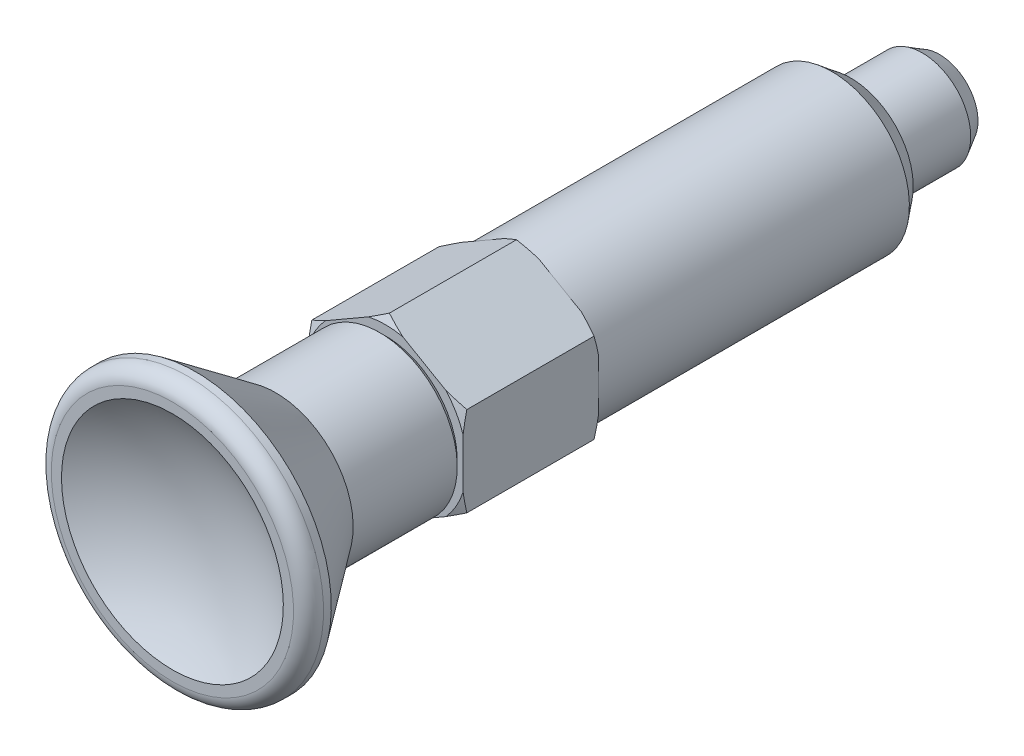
ISO-10303-21;
HEADER;
FILE_DESCRIPTION(('STEP AP214'),'2;1');
FILE_NAME('part.step','',(''),(''),'','','');
FILE_SCHEMA(('AUTOMOTIVE_DESIGN { 1 0 10303 214 1 1 1 1 }'));
ENDSEC;
DATA;
#1=APPLICATION_CONTEXT('core data for automotive mechanical design processes');
#2=APPLICATION_PROTOCOL_DEFINITION('international standard','automotive_design',2000,#1);
#3=PRODUCT_CONTEXT('',#1,'mechanical');
#4=PRODUCT('Part','Part','',(#3));
#5=PRODUCT_RELATED_PRODUCT_CATEGORY('part','',(#4));
#6=PRODUCT_DEFINITION_FORMATION('','',#4);
#7=PRODUCT_DEFINITION_CONTEXT('part definition',#1,'design');
#8=PRODUCT_DEFINITION('design','',#6,#7);
#9=PRODUCT_DEFINITION_SHAPE('','',#8);
#10=(LENGTH_UNIT() NAMED_UNIT(*) SI_UNIT(.MILLI.,.METRE.));
#11=(NAMED_UNIT(*) PLANE_ANGLE_UNIT() SI_UNIT($,.RADIAN.));
#12=(NAMED_UNIT(*) SI_UNIT($,.STERADIAN.) SOLID_ANGLE_UNIT());
#13=UNCERTAINTY_MEASURE_WITH_UNIT(LENGTH_MEASURE(1.E-05),#10,'distance_accuracy_value','');
#14=(GEOMETRIC_REPRESENTATION_CONTEXT(3) GLOBAL_UNCERTAINTY_ASSIGNED_CONTEXT((#13)) GLOBAL_UNIT_ASSIGNED_CONTEXT((#10,
#11,#12)) REPRESENTATION_CONTEXT('',''));
#15=CARTESIAN_POINT('',(0.,0.,0.));
#16=DIRECTION('',(0.,0.,1.));
#17=DIRECTION('',(1.,0.,0.));
#18=AXIS2_PLACEMENT_3D('',#15,#16,#17);
#19=CARTESIAN_POINT('',(0.,0.,0.243246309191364));
#20=DIRECTION('',(0.,0.,1.));
#21=DIRECTION('',(0.,-1.,0.));
#22=AXIS2_PLACEMENT_3D('',#19,#20,#21);
#23=CONICAL_SURFACE('',#22,4.62131496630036,1.04719755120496);
#24=CARTESIAN_POINT('',(4.00000000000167,-1.28062484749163,-1.11854969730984E-11));
#25=CARTESIAN_POINT('',(4.0000000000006,-1.3674395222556,0.0152814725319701));
#26=CARTESIAN_POINT('',(4.00000000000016,-1.4540064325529,0.0319318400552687));
#27=CARTESIAN_POINT('',(3.99999999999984,-1.62655847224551,0.0677326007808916));
#28=CARTESIAN_POINT('',(3.99999999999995,-1.71254397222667,0.0868812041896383));
#29=CARTESIAN_POINT('',(4.00000000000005,-1.88396214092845,0.127461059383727));
#30=CARTESIAN_POINT('',(4.00000000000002,-1.96939486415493,0.148892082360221));
#31=CARTESIAN_POINT('',(3.99999999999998,-2.13977657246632,0.193837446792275));
#32=CARTESIAN_POINT('',(3.99999999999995,-2.22472516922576,0.217353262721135));
#33=CARTESIAN_POINT('',(4.,-2.30940099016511,0.241795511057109));
#34=B_SPLINE_CURVE_WITH_KNOTS('',3,(#24,#25,#26,#27,#28,#29,#30,#31,#32,#33),.UNSPECIFIED.,.F.,
.F.,(4,2,2,2,4),(0.,0.264427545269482,0.528666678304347,0.792879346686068,1.05728039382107),.UNSPECIFIED.);
#35=CARTESIAN_POINT('',(4.,-1.28062484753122,-3.20837106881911E-12));
#36=VERTEX_POINT('',#35);
#37=CARTESIAN_POINT('',(4.00000001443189,-2.30940106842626,0.241795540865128));
#38=VERTEX_POINT('',#37);
#39=EDGE_CURVE('E156',#36,#38,#34,.T.);
#40=ORIENTED_EDGE('',*,*,#39,.T.);
#41=CARTESIAN_POINT('',(4.00000002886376,-2.30940106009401,0.241795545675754));
#42=CARTESIAN_POINT('',(3.92666860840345,-2.35173897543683,0.217353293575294));
#43=CARTESIAN_POINT('',(3.85310095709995,-2.39421327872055,0.193837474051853));
#44=CARTESIAN_POINT('',(3.70554605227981,-2.47940414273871,0.148892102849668));
#45=CARTESIAN_POINT('',(3.63155913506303,-2.52212050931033,0.127461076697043));
#46=CARTESIAN_POINT('',(3.48310662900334,-2.60782960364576,0.086881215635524));
#47=CARTESIAN_POINT('',(3.40864099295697,-2.65082235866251,0.0677326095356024));
#48=CARTESIAN_POINT('',(3.2592065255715,-2.73709838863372,0.0319318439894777));
#49=CARTESIAN_POINT('',(3.18423737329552,-2.78038184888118,0.0152814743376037));
#50=CARTESIAN_POINT('',(3.10905365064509,-2.82378919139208,-1.02235928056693E-11));
#51=B_SPLINE_CURVE_WITH_KNOTS('',3,(#41,#42,#43,#44,#45,#46,#47,#48,#49,#50),.UNSPECIFIED.,.F.,
.F.,(4,2,2,2,4),(0.,0.264401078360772,0.528613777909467,0.792852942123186,1.05728051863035),.UNSPECIFIED.);
#52=CARTESIAN_POINT('',(3.10905365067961,-2.82378919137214,-3.20663634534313E-12));
#53=VERTEX_POINT('',#52);
#54=EDGE_CURVE('E165',#38,#53,#51,.T.);
#55=ORIENTED_EDGE('',*,*,#54,.T.);
#56=CARTESIAN_POINT('',(0.,0.,3.79123815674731E-12));
#57=DIRECTION('',(0.,0.,1.));
#58=DIRECTION('',(0.,-1.,0.));
#59=AXIS2_PLACEMENT_3D('',#56,#57,#58);
#60=CIRCLE('',#59,4.20000000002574);
#61=EDGE_CURVE('E169',#36,#53,#60,.F.);
#62=ORIENTED_EDGE('',*,*,#61,.F.);
#63=EDGE_LOOP('',(#40,#55,#62));
#64=FACE_BOUND('',#63,.T.);
#65=ADVANCED_FACE('F15',(#64),#23,.T.);
#66=CARTESIAN_POINT('',(0.,0.,0.243246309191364));
#67=DIRECTION('',(0.,0.,1.));
#68=DIRECTION('',(0.,-1.,0.));
#69=AXIS2_PLACEMENT_3D('',#66,#67,#68);
#70=CONICAL_SURFACE('',#69,4.62131496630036,1.04719755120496);
#71=CARTESIAN_POINT('',(0.890946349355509,-4.10441403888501,-1.11811601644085E-11));
#72=CARTESIAN_POINT('',(0.815762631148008,-4.14782137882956,0.0152814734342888));
#73=CARTESIAN_POINT('',(0.740793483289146,-4.19110483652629,0.0319318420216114));
#74=CARTESIAN_POINT('',(0.591359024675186,-4.27738086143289,0.0677326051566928));
#75=CARTESIAN_POINT('',(0.516893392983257,-4.32037361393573,0.0868812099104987));
#76=CARTESIAN_POINT('',(0.368440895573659,-4.40608270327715,0.127461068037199));
#77=CARTESIAN_POINT('',(0.294453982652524,-4.44879906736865,0.148892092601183));
#78=CARTESIAN_POINT('',(0.146899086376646,-4.53398992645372,0.193837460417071));
#79=CARTESIAN_POINT('',(0.0733314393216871,-4.57646422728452,0.217353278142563));
#80=CARTESIAN_POINT('',(2.30832088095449E-08,-4.61880214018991,0.241795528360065));
#81=B_SPLINE_CURVE_WITH_KNOTS('',3,(#71,#72,#73,#74,#75,#76,#77,#78,#79,#80),.UNSPECIFIED.,.F.,
.F.,(4,2,2,2,4),(0.,0.264427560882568,0.528666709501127,0.792879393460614,1.05728045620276),.UNSPECIFIED.);
#82=CARTESIAN_POINT('',(0.890946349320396,-4.10441403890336,-3.20663634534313E-12));
#83=VERTEX_POINT('',#82);
#84=CARTESIAN_POINT('',(-1.15416038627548E-08,-4.61880214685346,0.241795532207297));
#85=VERTEX_POINT('',#84);
#86=EDGE_CURVE('E479',#83,#85,#81,.T.);
#87=ORIENTED_EDGE('',*,*,#86,.T.);
#88=CARTESIAN_POINT('',(-2.30832078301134E-08,-4.61880214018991,0.241795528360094));
#89=CARTESIAN_POINT('',(-0.0733314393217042,-4.57646422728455,0.217353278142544));
#90=CARTESIAN_POINT('',(-0.146899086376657,-4.53398992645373,0.193837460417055));
#91=CARTESIAN_POINT('',(-0.294453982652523,-4.44879906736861,0.148892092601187));
#92=CARTESIAN_POINT('',(-0.368440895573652,-4.40608270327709,0.127461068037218));
#93=CARTESIAN_POINT('',(-0.516893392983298,-4.32037361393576,0.0868812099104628));
#94=CARTESIAN_POINT('',(-0.591359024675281,-4.27738086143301,0.0677326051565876));
#95=CARTESIAN_POINT('',(-0.740793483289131,-4.1911048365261,0.0319318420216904));
#96=CARTESIAN_POINT('',(-0.815762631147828,-4.14782137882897,0.0152814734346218));
#97=CARTESIAN_POINT('',(-0.890946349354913,-4.10441403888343,-1.02279296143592E-11));
#98=B_SPLINE_CURVE_WITH_KNOTS('',3,(#88,#89,#90,#91,#92,#93,#94,#95,#96,#97),.UNSPECIFIED.,.F.,
.F.,(4,2,2,2,4),(0.,0.264401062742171,0.528613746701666,0.792852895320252,1.05728045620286),.UNSPECIFIED.);
#99=CARTESIAN_POINT('',(-0.890946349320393,-4.10441403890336,-3.2092384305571E-12));
#100=VERTEX_POINT('',#99);
#101=EDGE_CURVE('E523',#85,#100,#98,.T.);
#102=ORIENTED_EDGE('',*,*,#101,.T.);
#103=CARTESIAN_POINT('',(0.,0.,3.79123815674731E-12));
#104=DIRECTION('',(0.,0.,1.));
#105=DIRECTION('',(0.,-1.,0.));
#106=AXIS2_PLACEMENT_3D('',#103,#104,#105);
#107=CIRCLE('',#106,4.20000000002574);
#108=EDGE_CURVE('E350',#83,#100,#107,.F.);
#109=ORIENTED_EDGE('',*,*,#108,.F.);
#110=EDGE_LOOP('',(#87,#102,#109));
#111=FACE_BOUND('',#110,.T.);
#112=ADVANCED_FACE('F528',(#111),#70,.T.);
#113=CARTESIAN_POINT('',(0.,0.,0.243246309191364));
#114=DIRECTION('',(0.,0.,1.));
#115=DIRECTION('',(0.,-1.,0.));
#116=AXIS2_PLACEMENT_3D('',#113,#114,#115);
#117=CONICAL_SURFACE('',#116,4.62131496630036,1.04719755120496);
#118=CARTESIAN_POINT('',(-4.,-2.3094011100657,0.241795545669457));
#119=CARTESIAN_POINT('',(-4.,-2.22472527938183,0.217353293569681));
#120=CARTESIAN_POINT('',(-4.,-2.13977667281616,0.193837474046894));
#121=CARTESIAN_POINT('',(-4.,-1.96939494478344,0.14889210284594));
#122=CARTESIAN_POINT('',(-4.,-1.883962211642,0.127461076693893));
#123=CARTESIAN_POINT('',(-4.,-1.71254402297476,0.0868812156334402));
#124=CARTESIAN_POINT('',(-4.,-1.62655851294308,0.0677326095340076));
#125=CARTESIAN_POINT('',(-4.,-1.45400645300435,0.0319318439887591));
#126=CARTESIAN_POINT('',(-4.,-1.36743953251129,0.015281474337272));
#127=CARTESIAN_POINT('',(-4.,-1.28062484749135,-1.02270622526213E-11));
#128=B_SPLINE_CURVE_WITH_KNOTS('',3,(#118,#119,#120,#121,#122,#123,#124,#125,#126,#127),
.UNSPECIFIED.,.F.,.F.,(4,2,2,2,4),(0.,0.264401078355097,0.528613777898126,0.792852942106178,
1.05728051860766),.UNSPECIFIED.);
#129=CARTESIAN_POINT('',(-4.,-2.3094010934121,0.241795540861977));
#130=VERTEX_POINT('',#129);
#131=CARTESIAN_POINT('',(-4.,-1.28062484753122,-3.20837106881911E-12));
#132=VERTEX_POINT('',#131);
#133=EDGE_CURVE('E884',#130,#132,#128,.T.);
#134=ORIENTED_EDGE('',*,*,#133,.T.);
#135=CARTESIAN_POINT('',(0.,0.,3.79123815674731E-12));
#136=DIRECTION('',(0.,0.,1.));
#137=DIRECTION('',(0.,-1.,0.));
#138=AXIS2_PLACEMENT_3D('',#135,#136,#137);
#139=CIRCLE('',#138,4.20000000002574);
#140=CARTESIAN_POINT('',(-3.10905365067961,-2.82378919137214,-3.20837106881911E-12));
#141=VERTEX_POINT('',#140);
#142=EDGE_CURVE('E347',#141,#132,#139,.F.);
#143=ORIENTED_EDGE('',*,*,#142,.F.);
#144=CARTESIAN_POINT('',(-3.10905365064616,-2.82378919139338,-1.11854969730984E-11));
#145=CARTESIAN_POINT('',(-3.18423736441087,-2.78038185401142,0.0152814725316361));
#146=CARTESIAN_POINT('',(-3.25920650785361,-2.73709839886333,0.0319318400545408));
#147=CARTESIAN_POINT('',(-3.40864095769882,-2.65082237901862,0.0677326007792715));
#148=CARTESIAN_POINT('',(-3.48310658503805,-2.60782962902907,0.0868812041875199));
#149=CARTESIAN_POINT('',(-3.63155907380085,-2.52212054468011,0.127461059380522));
#150=CARTESIAN_POINT('',(-3.70554598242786,-2.47940418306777,0.148892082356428));
#151=CARTESIAN_POINT('',(-3.85310087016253,-2.39421332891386,0.193837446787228));
#152=CARTESIAN_POINT('',(-3.92666851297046,-2.35173903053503,0.217353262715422));
#153=CARTESIAN_POINT('',(-3.9999999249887,-2.30940112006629,0.241795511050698));
#154=B_SPLINE_CURVE_WITH_KNOTS('',3,(#144,#145,#146,#147,#148,#149,#150,#151,#152,#153),
.UNSPECIFIED.,.F.,.F.,(4,2,2,2,4),(0.,0.264427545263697,0.528666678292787,0.792879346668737,
1.05728039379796),.UNSPECIFIED.);
#155=EDGE_CURVE('E515',#141,#130,#154,.T.);
#156=ORIENTED_EDGE('',*,*,#155,.T.);
#157=EDGE_LOOP('',(#134,#143,#156));
#158=FACE_BOUND('',#157,.T.);
#159=ADVANCED_FACE('F532',(#158),#117,.T.);
#160=CARTESIAN_POINT('',(0.,0.,0.243246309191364));
#161=DIRECTION('',(0.,0.,1.));
#162=DIRECTION('',(0.,-1.,0.));
#163=AXIS2_PLACEMENT_3D('',#160,#161,#162);
#164=CONICAL_SURFACE('',#163,4.62131496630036,1.04719755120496);
#165=CARTESIAN_POINT('',(-4.00000000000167,1.28062484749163,-1.11846296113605E-11));
#166=CARTESIAN_POINT('',(-4.0000000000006,1.3674395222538,0.0152814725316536));
#167=CARTESIAN_POINT('',(-4.00000000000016,1.45400643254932,0.0319318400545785));
#168=CARTESIAN_POINT('',(-3.99999999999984,1.62655847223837,0.0677326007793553));
#169=CARTESIAN_POINT('',(-3.99999999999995,1.71254397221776,0.0868812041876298));
#170=CARTESIAN_POINT('',(-4.00000000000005,1.88396214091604,0.127461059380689));
#171=CARTESIAN_POINT('',(-4.00000000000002,1.96939486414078,0.148892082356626));
#172=CARTESIAN_POINT('',(-3.99999999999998,2.13977657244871,0.193837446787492));
#173=CARTESIAN_POINT('',(-3.99999999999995,2.22472516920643,0.217353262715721));
#174=CARTESIAN_POINT('',(-4.,2.30940099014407,0.241795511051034));
#175=B_SPLINE_CURVE_WITH_KNOTS('',3,(#165,#166,#167,#168,#169,#170,#171,#172,#173,#174),
.UNSPECIFIED.,.F.,.F.,(4,2,2,2,4),(0.,0.264427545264,0.528666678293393,0.792879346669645,
1.05728039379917),.UNSPECIFIED.);
#176=CARTESIAN_POINT('',(-4.,1.28062484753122,-3.20837106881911E-12));
#177=VERTEX_POINT('',#176);
#178=CARTESIAN_POINT('',(-4.00000001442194,2.309401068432,0.241795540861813));
#179=VERTEX_POINT('',#178);
#180=EDGE_CURVE('E887',#177,#179,#175,.T.);
#181=ORIENTED_EDGE('',*,*,#180,.T.);
#182=CARTESIAN_POINT('',(-4.00000002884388,2.30940106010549,0.241795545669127));
#183=CARTESIAN_POINT('',(-3.92666860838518,2.35173897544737,0.217353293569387));
#184=CARTESIAN_POINT('',(-3.85310095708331,2.39421327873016,0.193837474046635));
#185=CARTESIAN_POINT('',(-3.70554605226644,2.47940414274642,0.148892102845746));
#186=CARTESIAN_POINT('',(-3.6315591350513,2.5221205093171,0.127461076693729));
#187=CARTESIAN_POINT('',(-3.48310662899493,2.60782960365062,0.0868812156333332));
#188=CARTESIAN_POINT('',(-3.40864099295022,2.65082235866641,0.0677326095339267));
#189=CARTESIAN_POINT('',(-3.25920652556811,2.73709838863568,0.0319318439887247));
#190=CARTESIAN_POINT('',(-3.18423737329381,2.78038184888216,0.0152814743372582));
#191=CARTESIAN_POINT('',(-3.10905365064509,2.82378919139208,-1.02235928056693E-11));
#192=B_SPLINE_CURVE_WITH_KNOTS('',3,(#182,#183,#184,#185,#186,#187,#188,#189,#190,#191),
.UNSPECIFIED.,.F.,.F.,(4,2,2,2,4),(0.,0.264401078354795,0.528613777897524,0.792852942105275,
1.05728051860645),.UNSPECIFIED.);
#193=CARTESIAN_POINT('',(-3.10905365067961,2.82378919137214,-3.20663634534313E-12));
#194=VERTEX_POINT('',#193);
#195=EDGE_CURVE('E927',#179,#194,#192,.T.);
#196=ORIENTED_EDGE('',*,*,#195,.T.);
#197=CARTESIAN_POINT('',(0.,0.,3.79123815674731E-12));
#198=DIRECTION('',(0.,0.,1.));
#199=DIRECTION('',(0.,-1.,0.));
#200=AXIS2_PLACEMENT_3D('',#197,#198,#199);
#201=CIRCLE('',#200,4.20000000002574);
#202=EDGE_CURVE('E337',#177,#194,#201,.F.);
#203=ORIENTED_EDGE('',*,*,#202,.F.);
#204=EDGE_LOOP('',(#181,#196,#203));
#205=FACE_BOUND('',#204,.T.);
#206=ADVANCED_FACE('F810',(#205),#164,.T.);
#207=CARTESIAN_POINT('',(0.,0.,0.243246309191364));
#208=DIRECTION('',(0.,0.,1.));
#209=DIRECTION('',(0.,-1.,0.));
#210=AXIS2_PLACEMENT_3D('',#207,#208,#209);
#211=CONICAL_SURFACE('',#210,4.62131496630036,1.04719755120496);
#212=CARTESIAN_POINT('',(-0.890946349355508,4.10441403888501,-1.11811601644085E-11));
#213=CARTESIAN_POINT('',(-0.815762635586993,4.14782137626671,0.0152814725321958));
#214=CARTESIAN_POINT('',(-0.740793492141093,4.19110483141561,0.0319318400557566));
#215=CARTESIAN_POINT('',(-0.591359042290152,4.27738085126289,0.0677326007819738));
#216=CARTESIAN_POINT('',(-0.51689341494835,4.32037360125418,0.0868812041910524));
#217=CARTESIAN_POINT('',(-0.368440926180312,4.40608268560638,0.127461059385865));
#218=CARTESIAN_POINT('',(-0.294454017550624,4.44879904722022,0.14889208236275));
#219=CARTESIAN_POINT('',(-0.146899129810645,4.53398990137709,0.193837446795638));
#220=CARTESIAN_POINT('',(-0.0733314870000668,4.57646419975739,0.217353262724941));
#221=CARTESIAN_POINT('',(-7.49792699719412E-08,4.61880211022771,0.241795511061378));
#222=B_SPLINE_CURVE_WITH_KNOTS('',3,(#212,#213,#214,#215,#216,#217,#218,#219,#220,#221),
.UNSPECIFIED.,.F.,.F.,(4,2,2,2,4),(0.,0.264427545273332,0.52866667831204,0.792879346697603,
1.05728039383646),.UNSPECIFIED.);
#223=CARTESIAN_POINT('',(-0.890946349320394,4.10441403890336,-3.20663634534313E-12));
#224=VERTEX_POINT('',#223);
#225=CARTESIAN_POINT('',(-1.44253457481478E-08,4.61880216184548,0.241795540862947));
#226=VERTEX_POINT('',#225);
#227=EDGE_CURVE('E182',#224,#226,#222,.T.);
#228=ORIENTED_EDGE('',*,*,#227,.T.);
#229=CARTESIAN_POINT('',(-2.88506914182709E-08,4.61880217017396,0.241795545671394));
#230=CARTESIAN_POINT('',(0.0733313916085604,4.57646425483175,0.217353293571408));
#231=CARTESIAN_POINT('',(0.146899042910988,4.53398995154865,0.19383747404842));
#232=CARTESIAN_POINT('',(0.294453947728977,4.44879908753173,0.148892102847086));
#233=CARTESIAN_POINT('',(0.368440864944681,4.40608272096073,0.127461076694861));
#234=CARTESIAN_POINT('',(0.516893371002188,4.32037362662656,0.0868812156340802));
#235=CARTESIAN_POINT('',(0.59135900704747,4.27738087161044,0.0677326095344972));
#236=CARTESIAN_POINT('',(0.740793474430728,4.1911048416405,0.0319318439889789));
#237=CARTESIAN_POINT('',(0.815762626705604,4.14782138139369,0.0152814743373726));
#238=CARTESIAN_POINT('',(0.890946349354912,4.10441403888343,-1.02279296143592E-11));
#239=B_SPLINE_CURVE_WITH_KNOTS('',3,(#229,#230,#231,#232,#233,#234,#235,#236,#237,#238),
.UNSPECIFIED.,.F.,.F.,(4,2,2,2,4),(0.,0.264401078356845,0.528613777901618,0.792852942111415,
1.05728051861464),.UNSPECIFIED.);
#240=CARTESIAN_POINT('',(0.890946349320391,4.10441403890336,-3.2092384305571E-12));
#241=VERTEX_POINT('',#240);
#242=EDGE_CURVE('E180',#226,#241,#239,.T.);
#243=ORIENTED_EDGE('',*,*,#242,.T.);
#244=CARTESIAN_POINT('',(0.,0.,3.79123815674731E-12));
#245=DIRECTION('',(0.,0.,1.));
#246=DIRECTION('',(0.,-1.,0.));
#247=AXIS2_PLACEMENT_3D('',#244,#245,#246);
#248=CIRCLE('',#247,4.20000000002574);
#249=EDGE_CURVE('E330',#224,#241,#248,.F.);
#250=ORIENTED_EDGE('',*,*,#249,.F.);
#251=EDGE_LOOP('',(#228,#243,#250));
#252=FACE_BOUND('',#251,.T.);
#253=ADVANCED_FACE('F392',(#252),#211,.T.);
#254=CARTESIAN_POINT('',(4.,0.,0.));
#255=DIRECTION('',(0.,0.,-1.));
#256=DIRECTION('',(0.,1.,0.));
#257=AXIS2_PLACEMENT_3D('',#254,#255,#256);
#258=PLANE('',#257);
#259=ORIENTED_EDGE('',*,*,#61,.T.);
#260=DIRECTION('',(-0.866025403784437,-0.5,0.));
#261=VECTOR('',#260,1.);
#262=CARTESIAN_POINT('',(3.10905365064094,-2.82378919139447,0.));
#263=LINE('',#262,#261);
#264=CARTESIAN_POINT('',(2.,-3.46410161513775,0.));
#265=VERTEX_POINT('',#264);
#266=EDGE_CURVE('E174',#53,#265,#263,.T.);
#267=ORIENTED_EDGE('',*,*,#266,.T.);
#268=CARTESIAN_POINT('',(0.,0.,0.));
#269=DIRECTION('',(0.,0.,1.));
#270=DIRECTION('',(0.,-1.,0.));
#271=AXIS2_PLACEMENT_3D('',#268,#269,#270);
#272=CIRCLE('',#271,4.);
#273=CARTESIAN_POINT('',(4.,0.,0.));
#274=VERTEX_POINT('',#273);
#275=EDGE_CURVE('E178',#274,#265,#272,.F.);
#276=ORIENTED_EDGE('',*,*,#275,.F.);
#277=DIRECTION('',(0.,1.,0.));
#278=VECTOR('',#277,1.);
#279=CARTESIAN_POINT('',(4.,0.,0.));
#280=LINE('',#279,#278);
#281=EDGE_CURVE('E160',#274,#36,#280,.F.);
#282=ORIENTED_EDGE('',*,*,#281,.T.);
#283=EDGE_LOOP('',(#259,#267,#276,#282));
#284=FACE_BOUND('',#283,.T.);
#285=ADVANCED_FACE('F176',(#284),#258,.T.);
#286=CARTESIAN_POINT('',(4.,0.,0.));
#287=DIRECTION('',(0.,0.,-1.));
#288=DIRECTION('',(0.,1.,0.));
#289=AXIS2_PLACEMENT_3D('',#286,#287,#288);
#290=PLANE('',#289);
#291=ORIENTED_EDGE('',*,*,#108,.T.);
#292=DIRECTION('',(-0.866025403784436,0.5,0.));
#293=VECTOR('',#292,1.);
#294=CARTESIAN_POINT('',(-0.890946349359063,-4.10441403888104,0.));
#295=LINE('',#294,#293);
#296=CARTESIAN_POINT('',(-2.,-3.46410161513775,0.));
#297=VERTEX_POINT('',#296);
#298=EDGE_CURVE('E348',#100,#297,#295,.T.);
#299=ORIENTED_EDGE('',*,*,#298,.T.);
#300=CARTESIAN_POINT('',(0.,0.,0.));
#301=DIRECTION('',(0.,0.,1.));
#302=DIRECTION('',(0.,-1.,0.));
#303=AXIS2_PLACEMENT_3D('',#300,#301,#302);
#304=CIRCLE('',#303,4.);
#305=EDGE_CURVE('E358',#265,#297,#304,.F.);
#306=ORIENTED_EDGE('',*,*,#305,.F.);
#307=DIRECTION('',(-0.86602540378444,-0.5,0.));
#308=VECTOR('',#307,1.);
#309=CARTESIAN_POINT('',(2.,-3.46410161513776,0.));
#310=LINE('',#309,#308);
#311=EDGE_CURVE('E351',#265,#83,#310,.T.);
#312=ORIENTED_EDGE('',*,*,#311,.T.);
#313=EDGE_LOOP('',(#291,#299,#306,#312));
#314=FACE_BOUND('',#313,.T.);
#315=ADVANCED_FACE('F359',(#314),#290,.T.);
#316=CARTESIAN_POINT('',(4.,0.,0.));
#317=DIRECTION('',(0.,0.,-1.));
#318=DIRECTION('',(0.,1.,0.));
#319=AXIS2_PLACEMENT_3D('',#316,#317,#318);
#320=PLANE('',#319);
#321=CARTESIAN_POINT('',(0.,0.,0.));
#322=DIRECTION('',(0.,0.,1.));
#323=DIRECTION('',(0.,-1.,0.));
#324=AXIS2_PLACEMENT_3D('',#321,#322,#323);
#325=CIRCLE('',#324,4.);
#326=CARTESIAN_POINT('',(-4.,0.,0.));
#327=VERTEX_POINT('',#326);
#328=EDGE_CURVE('E364',#297,#327,#325,.F.);
#329=ORIENTED_EDGE('',*,*,#328,.F.);
#330=DIRECTION('',(-0.86602540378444,0.5,0.));
#331=VECTOR('',#330,1.);
#332=CARTESIAN_POINT('',(-2.,-3.46410161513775,0.));
#333=LINE('',#332,#331);
#334=EDGE_CURVE('E341',#297,#141,#333,.T.);
#335=ORIENTED_EDGE('',*,*,#334,.T.);
#336=ORIENTED_EDGE('',*,*,#142,.T.);
#337=DIRECTION('',(0.,1.,0.));
#338=VECTOR('',#337,1.);
#339=CARTESIAN_POINT('',(-4.,0.,0.));
#340=LINE('',#339,#338);
#341=EDGE_CURVE('E344',#132,#327,#340,.T.);
#342=ORIENTED_EDGE('',*,*,#341,.T.);
#343=EDGE_LOOP('',(#329,#335,#336,#342));
#344=FACE_BOUND('',#343,.T.);
#345=ADVANCED_FACE('F784',(#344),#320,.T.);
#346=CARTESIAN_POINT('',(4.,0.,0.));
#347=DIRECTION('',(0.,0.,-1.));
#348=DIRECTION('',(0.,1.,0.));
#349=AXIS2_PLACEMENT_3D('',#346,#347,#348);
#350=PLANE('',#349);
#351=ORIENTED_EDGE('',*,*,#202,.T.);
#352=DIRECTION('',(0.866025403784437,0.5,0.));
#353=VECTOR('',#352,1.);
#354=CARTESIAN_POINT('',(-3.10905365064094,2.82378919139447,0.));
#355=LINE('',#354,#353);
#356=CARTESIAN_POINT('',(-2.,3.46410161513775,0.));
#357=VERTEX_POINT('',#356);
#358=EDGE_CURVE('E334',#194,#357,#355,.T.);
#359=ORIENTED_EDGE('',*,*,#358,.T.);
#360=CARTESIAN_POINT('',(0.,0.,0.));
#361=DIRECTION('',(0.,0.,1.));
#362=DIRECTION('',(0.,-1.,0.));
#363=AXIS2_PLACEMENT_3D('',#360,#361,#362);
#364=CIRCLE('',#363,4.);
#365=EDGE_CURVE('E953',#327,#357,#364,.F.);
#366=ORIENTED_EDGE('',*,*,#365,.F.);
#367=DIRECTION('',(0.,1.,0.));
#368=VECTOR('',#367,1.);
#369=CARTESIAN_POINT('',(-4.,0.,0.));
#370=LINE('',#369,#368);
#371=EDGE_CURVE('E338',#327,#177,#370,.T.);
#372=ORIENTED_EDGE('',*,*,#371,.T.);
#373=EDGE_LOOP('',(#351,#359,#366,#372));
#374=FACE_BOUND('',#373,.T.);
#375=ADVANCED_FACE('F776',(#374),#350,.T.);
#376=CARTESIAN_POINT('',(4.,0.,0.));
#377=DIRECTION('',(0.,0.,-1.));
#378=DIRECTION('',(0.,1.,0.));
#379=AXIS2_PLACEMENT_3D('',#376,#377,#378);
#380=PLANE('',#379);
#381=ORIENTED_EDGE('',*,*,#249,.T.);
#382=DIRECTION('',(0.866025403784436,-0.5,0.));
#383=VECTOR('',#382,1.);
#384=CARTESIAN_POINT('',(0.890946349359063,4.10441403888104,0.));
#385=LINE('',#384,#383);
#386=CARTESIAN_POINT('',(2.,3.46410161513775,0.));
#387=VERTEX_POINT('',#386);
#388=EDGE_CURVE('E328',#241,#387,#385,.T.);
#389=ORIENTED_EDGE('',*,*,#388,.T.);
#390=CARTESIAN_POINT('',(0.,0.,0.));
#391=DIRECTION('',(0.,0.,1.));
#392=DIRECTION('',(0.,-1.,0.));
#393=AXIS2_PLACEMENT_3D('',#390,#391,#392);
#394=CIRCLE('',#393,4.);
#395=EDGE_CURVE('E955',#357,#387,#394,.F.);
#396=ORIENTED_EDGE('',*,*,#395,.F.);
#397=DIRECTION('',(0.86602540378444,0.5,0.));
#398=VECTOR('',#397,1.);
#399=CARTESIAN_POINT('',(-2.,3.46410161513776,0.));
#400=LINE('',#399,#398);
#401=EDGE_CURVE('E331',#357,#224,#400,.T.);
#402=ORIENTED_EDGE('',*,*,#401,.T.);
#403=EDGE_LOOP('',(#381,#389,#396,#402));
#404=FACE_BOUND('',#403,.T.);
#405=ADVANCED_FACE('F769',(#404),#380,.T.);
#406=CARTESIAN_POINT('',(0.,0.,-17.));
#407=DIRECTION('',(0.,0.,1.));
#408=DIRECTION('',(0.,-1.,0.));
#409=AXIS2_PLACEMENT_3D('',#406,#407,#408);
#410=CYLINDRICAL_SURFACE('',#409,4.);
#411=ORIENTED_EDGE('',*,*,#365,.T.);
#412=ORIENTED_EDGE('',*,*,#395,.T.);
#413=CARTESIAN_POINT('',(0.,0.,0.));
#414=DIRECTION('',(0.,0.,1.));
#415=DIRECTION('',(0.,-1.,0.));
#416=AXIS2_PLACEMENT_3D('',#413,#414,#415);
#417=CIRCLE('',#416,4.);
#418=EDGE_CURVE('E327',#274,#387,#417,.T.);
#419=ORIENTED_EDGE('',*,*,#418,.F.);
#420=ORIENTED_EDGE('',*,*,#275,.T.);
#421=ORIENTED_EDGE('',*,*,#305,.T.);
#422=ORIENTED_EDGE('',*,*,#328,.T.);
#423=EDGE_LOOP('',(#411,#412,#419,#420,#421,#422));
#424=FACE_BOUND('',#423,.T.);
#425=CARTESIAN_POINT('',(0.,0.,-16.033));
#426=DIRECTION('',(0.,0.,1.));
#427=DIRECTION('',(0.,-1.,0.));
#428=AXIS2_PLACEMENT_3D('',#425,#426,#427);
#429=CIRCLE('',#428,4.);
#430=CARTESIAN_POINT('',(0.,-4.,-16.033));
#431=VERTEX_POINT('',#430);
#432=EDGE_CURVE('E166',#431,#431,#429,.T.);
#433=ORIENTED_EDGE('',*,*,#432,.T.);
#434=EDGE_LOOP('',(#433));
#435=FACE_BOUND('',#434,.T.);
#436=ADVANCED_FACE('F367',(#424,#435),#410,.T.);
#437=CARTESIAN_POINT('',(4.,0.,0.));
#438=DIRECTION('',(0.,0.,-1.));
#439=DIRECTION('',(0.,1.,0.));
#440=AXIS2_PLACEMENT_3D('',#437,#438,#439);
#441=PLANE('',#440);
#442=CARTESIAN_POINT('',(0.,0.,3.79123815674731E-12));
#443=DIRECTION('',(0.,0.,1.));
#444=DIRECTION('',(0.,-1.,0.));
#445=AXIS2_PLACEMENT_3D('',#442,#443,#444);
#446=CIRCLE('',#445,4.20000000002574);
#447=CARTESIAN_POINT('',(4.,1.28062484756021,1.89518539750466E-12));
#448=VERTEX_POINT('',#447);
#449=CARTESIAN_POINT('',(3.10905365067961,2.82378919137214,-3.20837106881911E-12));
#450=VERTEX_POINT('',#449);
#451=EDGE_CURVE('E324',#448,#450,#446,.T.);
#452=ORIENTED_EDGE('',*,*,#451,.F.);
#453=DIRECTION('',(0.,1.,0.));
#454=VECTOR('',#453,1.);
#455=CARTESIAN_POINT('',(4.,0.,0.));
#456=LINE('',#455,#454);
#457=EDGE_CURVE('E321',#448,#274,#456,.F.);
#458=ORIENTED_EDGE('',*,*,#457,.T.);
#459=ORIENTED_EDGE('',*,*,#418,.T.);
#460=DIRECTION('',(0.86602540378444,-0.5,0.));
#461=VECTOR('',#460,1.);
#462=CARTESIAN_POINT('',(2.,3.46410161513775,0.));
#463=LINE('',#462,#461);
#464=EDGE_CURVE('E325',#387,#450,#463,.T.);
#465=ORIENTED_EDGE('',*,*,#464,.T.);
#466=EDGE_LOOP('',(#452,#458,#459,#465));
#467=FACE_BOUND('',#466,.T.);
#468=ADVANCED_FACE('F756',(#467),#441,.T.);
#469=CARTESIAN_POINT('',(0.,0.,0.243246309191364));
#470=DIRECTION('',(0.,0.,1.));
#471=DIRECTION('',(0.,-1.,0.));
#472=AXIS2_PLACEMENT_3D('',#469,#470,#471);
#473=CONICAL_SURFACE('',#472,4.62131496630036,1.04719755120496);
#474=CARTESIAN_POINT('',(3.10905365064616,2.82378919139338,-1.11854969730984E-11));
#475=CARTESIAN_POINT('',(3.18423736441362,2.78038185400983,0.0152814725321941));
#476=CARTESIAN_POINT('',(3.25920650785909,2.73709839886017,0.0319318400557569));
#477=CARTESIAN_POINT('',(3.40864095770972,2.65082237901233,0.067732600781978));
#478=CARTESIAN_POINT('',(3.48310658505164,2.60782962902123,0.0868812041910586));
#479=CARTESIAN_POINT('',(3.63155907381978,2.52212054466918,0.127461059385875));
#480=CARTESIAN_POINT('',(3.70554598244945,2.4794041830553,0.148892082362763));
#481=CARTESIAN_POINT('',(3.8531008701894,2.39421332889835,0.193837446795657));
#482=CARTESIAN_POINT('',(3.92666851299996,2.351739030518,0.217353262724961));
#483=CARTESIAN_POINT('',(3.99999992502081,2.30940112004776,0.241795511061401));
#484=B_SPLINE_CURVE_WITH_KNOTS('',3,(#474,#475,#476,#477,#478,#479,#480,#481,#482,#483),
.UNSPECIFIED.,.F.,.F.,(4,2,2,2,4),(0.,0.264427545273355,0.528666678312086,0.792879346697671,
1.05728039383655),.UNSPECIFIED.);
#485=CARTESIAN_POINT('',(3.99999996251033,2.30940111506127,0.24179552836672));
#486=VERTEX_POINT('',#485);
#487=EDGE_CURVE('E410',#450,#486,#484,.T.);
#488=ORIENTED_EDGE('',*,*,#487,.T.);
#489=CARTESIAN_POINT('',(4.,1.2806248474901,-1.04465047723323E-11));
#490=CARTESIAN_POINT('',(4.,1.36743953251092,0.0152814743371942));
#491=CARTESIAN_POINT('',(4.,1.45400645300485,0.0319318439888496));
#492=CARTESIAN_POINT('',(4.,1.62655851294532,0.0677326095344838));
#493=CARTESIAN_POINT('',(4.,1.71254402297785,0.0868812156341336));
#494=CARTESIAN_POINT('',(4.,1.88396221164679,0.127461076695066));
#495=CARTESIAN_POINT('',(4.,1.96939494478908,0.148892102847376));
#496=CARTESIAN_POINT('',(4.,2.1397766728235,0.193837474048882));
#497=CARTESIAN_POINT('',(4.,2.22472527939,0.217353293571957));
#498=CARTESIAN_POINT('',(4.,2.30940111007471,0.241795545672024));
#499=B_SPLINE_CURVE_WITH_KNOTS('',3,(#489,#490,#491,#492,#493,#494,#495,#496,#497,#498),
.UNSPECIFIED.,.F.,.F.,(4,2,2,2,4),(0.,0.264427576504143,0.528666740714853,0.792879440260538,
1.05728051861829),.UNSPECIFIED.);
#500=EDGE_CURVE('E437',#448,#486,#499,.T.);
#501=ORIENTED_EDGE('',*,*,#500,.F.);
#502=ORIENTED_EDGE('',*,*,#451,.T.);
#503=EDGE_LOOP('',(#488,#501,#502));
#504=FACE_BOUND('',#503,.T.);
#505=ADVANCED_FACE('F444',(#504),#473,.T.);
#506=CARTESIAN_POINT('',(4.,-2.3094010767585,0.));
#507=DIRECTION('',(1.,0.,0.));
#508=DIRECTION('',(0.,1.,0.));
#509=AXIS2_PLACEMENT_3D('',#506,#507,#508);
#510=PLANE('',#509);
#511=ORIENTED_EDGE('',*,*,#457,.F.);
#512=ORIENTED_EDGE('',*,*,#500,.T.);
#513=DIRECTION('',(0.,0.,1.));
#514=VECTOR('',#513,1.);
#515=CARTESIAN_POINT('',(4.,2.3094010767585,0.));
#516=LINE('',#515,#514);
#517=CARTESIAN_POINT('',(4.,2.30940103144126,6.80470935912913));
#518=VERTEX_POINT('',#517);
#519=EDGE_CURVE('E316',#518,#486,#516,.F.);
#520=ORIENTED_EDGE('',*,*,#519,.F.);
#521=CARTESIAN_POINT('',(4.,1.28062484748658,7.));
#522=CARTESIAN_POINT('',(4.,1.36707256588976,6.98770999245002));
#523=CARTESIAN_POINT('',(4.,1.45335853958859,6.97431137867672));
#524=CARTESIAN_POINT('',(4.,1.62554619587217,6.94547091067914));
#525=CARTESIAN_POINT('',(4.,1.71144804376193,6.93003004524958));
#526=CARTESIAN_POINT('',(4.,1.88288440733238,6.89726795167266));
#527=CARTESIAN_POINT('',(4.,1.96841894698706,6.87994684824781));
#528=CARTESIAN_POINT('',(4.,2.13916422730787,6.84357962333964));
#529=CARTESIAN_POINT('',(4.,2.22437479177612,6.82453267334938));
#530=CARTESIAN_POINT('',(4.,2.30940098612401,6.80470936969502));
#531=B_SPLINE_CURVE_WITH_KNOTS('',3,(#521,#522,#523,#524,#525,#526,#527,#528,#529,#530),
.UNSPECIFIED.,.F.,.F.,(4,2,2,2,4),(0.,0.261937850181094,0.523749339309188,0.785543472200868,
1.04746395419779),.UNSPECIFIED.);
#532=CARTESIAN_POINT('',(4.,1.2806248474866,7.));
#533=VERTEX_POINT('',#532);
#534=EDGE_CURVE('E432',#533,#518,#531,.T.);
#535=ORIENTED_EDGE('',*,*,#534,.F.);
#536=DIRECTION('',(0.,-1.,0.));
#537=VECTOR('',#536,1.);
#538=CARTESIAN_POINT('',(4.,0.,7.));
#539=LINE('',#538,#537);
#540=CARTESIAN_POINT('',(4.,-1.28062484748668,7.));
#541=VERTEX_POINT('',#540);
#542=EDGE_CURVE('E291',#541,#533,#539,.F.);
#543=ORIENTED_EDGE('',*,*,#542,.F.);
#544=CARTESIAN_POINT('',(4.,-2.30940111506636,6.80470933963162));
#545=CARTESIAN_POINT('',(4.,-2.22437491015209,6.82453264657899));
#546=CARTESIAN_POINT('',(4.,-2.139164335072,6.8435795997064));
#547=CARTESIAN_POINT('',(4.,-1.96841903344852,6.87994683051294));
#548=CARTESIAN_POINT('',(4.,-1.88288448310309,6.89726793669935));
#549=CARTESIAN_POINT('',(4.,-1.71144809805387,6.93003003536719));
#550=CARTESIAN_POINT('',(4.,-1.62554623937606,6.94547090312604));
#551=CARTESIAN_POINT('',(4.,-1.4533585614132,6.97431137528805));
#552=CARTESIAN_POINT('',(4.,-1.36707257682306,6.98770999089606));
#553=CARTESIAN_POINT('',(4.,-1.2806248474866,7.00000000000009));
#554=B_SPLINE_CURVE_WITH_KNOTS('',3,(#544,#545,#546,#547,#548,#549,#550,#551,#552,#553),
.UNSPECIFIED.,.F.,.F.,(4,2,2,2,4),(0.,0.261920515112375,0.523714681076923,0.785526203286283,
1.04746408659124),.UNSPECIFIED.);
#555=CARTESIAN_POINT('',(4.,-2.30940109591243,6.80470934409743));
#556=VERTEX_POINT('',#555);
#557=EDGE_CURVE('E293',#556,#541,#554,.T.);
#558=ORIENTED_EDGE('',*,*,#557,.F.);
#559=DIRECTION('',(0.,0.,1.));
#560=VECTOR('',#559,1.);
#561=CARTESIAN_POINT('',(4.,-2.30940107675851,0.));
#562=LINE('',#561,#560);
#563=EDGE_CURVE('E163',#38,#556,#562,.T.);
#564=ORIENTED_EDGE('',*,*,#563,.F.);
#565=ORIENTED_EDGE('',*,*,#39,.F.);
#566=ORIENTED_EDGE('',*,*,#281,.F.);
#567=EDGE_LOOP('',(#511,#512,#520,#535,#543,#558,#564,#565,#566));
#568=FACE_BOUND('',#567,.T.);
#569=ADVANCED_FACE('F158',(#568),#510,.T.);
#570=CARTESIAN_POINT('',(0.,0.,6.80353760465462));
#571=DIRECTION('',(0.,0.,-1.));
#572=DIRECTION('',(0.,1.,0.));
#573=AXIS2_PLACEMENT_3D('',#570,#571,#572);
#574=CONICAL_SURFACE('',#573,4.62131496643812,1.13446401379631);
#575=CARTESIAN_POINT('',(3.10905365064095,2.82378919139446,7.));
#576=CARTESIAN_POINT('',(3.18391958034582,2.78056532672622,6.98770999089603));
#577=CARTESIAN_POINT('',(3.25864543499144,2.73742233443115,6.97431137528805));
#578=CARTESIAN_POINT('',(3.40776433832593,2.65132849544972,6.94547090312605));
#579=CARTESIAN_POINT('',(3.48215753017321,2.60837756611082,6.93003003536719));
#580=CARTESIAN_POINT('',(3.63062579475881,2.52265937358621,6.89726793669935));
#581=CARTESIAN_POINT('',(3.70470088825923,2.47989209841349,6.87994683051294));
#582=CARTESIAN_POINT('',(3.852570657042,2.39451944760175,6.84357959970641));
#583=CARTESIAN_POINT('',(3.92636517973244,2.3519141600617,6.82453264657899));
#584=CARTESIAN_POINT('',(4.00000003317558,2.30940105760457,6.80470933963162));
#585=B_SPLINE_CURVE_WITH_KNOTS('',3,(#575,#576,#577,#578,#579,#580,#581,#582,#583,#584),
.UNSPECIFIED.,.F.,.F.,(4,2,2,2,4),(0.,0.261937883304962,0.523749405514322,0.785543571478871,
1.04746408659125),.UNSPECIFIED.);
#586=CARTESIAN_POINT('',(3.10905365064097,2.82378919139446,7.));
#587=VERTEX_POINT('',#586);
#588=EDGE_CURVE('E320',#587,#518,#585,.T.);
#589=ORIENTED_EDGE('',*,*,#588,.F.);
#590=CARTESIAN_POINT('',(0.,0.,7.));
#591=DIRECTION('',(0.,0.,-1.));
#592=DIRECTION('',(0.,1.,0.));
#593=AXIS2_PLACEMENT_3D('',#590,#591,#592);
#594=CIRCLE('',#593,4.2);
#595=EDGE_CURVE('E290',#533,#587,#594,.F.);
#596=ORIENTED_EDGE('',*,*,#595,.F.);
#597=ORIENTED_EDGE('',*,*,#534,.T.);
#598=EDGE_LOOP('',(#589,#596,#597));
#599=FACE_BOUND('',#598,.T.);
#600=ADVANCED_FACE('F402',(#599),#574,.T.);
#601=CARTESIAN_POINT('',(4.,2.3094010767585,0.));
#602=DIRECTION('',(0.5,0.866025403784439,0.));
#603=DIRECTION('',(-0.866025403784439,0.5,0.));
#604=AXIS2_PLACEMENT_3D('',#601,#602,#603);
#605=PLANE('',#604);
#606=ORIENTED_EDGE('',*,*,#388,.F.);
#607=ORIENTED_EDGE('',*,*,#242,.F.);
#608=DIRECTION('',(0.,0.,1.));
#609=VECTOR('',#608,1.);
#610=CARTESIAN_POINT('',(0.,4.61880215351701,0.));
#611=LINE('',#610,#609);
#612=CARTESIAN_POINT('',(1.1329045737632E-08,4.61880214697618,6.80470935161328));
#613=VERTEX_POINT('',#612);
#614=EDGE_CURVE('E311',#613,#226,#611,.F.);
#615=ORIENTED_EDGE('',*,*,#614,.F.);
#616=CARTESIAN_POINT('',(0.890946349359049,4.10441403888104,7.));
#617=CARTESIAN_POINT('',(0.816080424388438,4.14763790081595,6.98770999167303));
#618=CARTESIAN_POINT('',(0.741354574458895,4.1907808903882,6.97431137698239));
#619=CARTESIAN_POINT('',(0.592235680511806,4.27687472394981,6.9454709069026));
#620=CARTESIAN_POINT('',(0.517842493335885,4.3198256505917,6.93003004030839));
#621=CARTESIAN_POINT('',(0.369374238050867,4.40554383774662,6.897267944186));
#622=CARTESIAN_POINT('',(0.295299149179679,4.44831111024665,6.87994683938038));
#623=CARTESIAN_POINT('',(0.14742938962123,4.53368375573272,6.84357961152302));
#624=CARTESIAN_POINT('',(0.0736348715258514,4.57628904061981,6.82453265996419));
#625=CARTESIAN_POINT('',(2.26580907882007E-08,4.61880214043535,6.80470935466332));
#626=B_SPLINE_CURVE_WITH_KNOTS('',3,(#616,#617,#618,#619,#620,#621,#622,#623,#624,#625),
.UNSPECIFIED.,.F.,.F.,(4,2,2,2,4),(0.,0.261937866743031,0.523749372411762,0.785543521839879,
1.04746402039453),.UNSPECIFIED.);
#627=CARTESIAN_POINT('',(0.890946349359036,4.10441403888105,7.));
#628=VERTEX_POINT('',#627);
#629=EDGE_CURVE('E319',#628,#613,#626,.T.);
#630=ORIENTED_EDGE('',*,*,#629,.F.);
#631=DIRECTION('',(-0.86602540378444,0.5,0.));
#632=VECTOR('',#631,1.);
#633=CARTESIAN_POINT('',(3.10905365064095,2.82378919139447,7.));
#634=LINE('',#633,#632);
#635=EDGE_CURVE('E287',#587,#628,#634,.T.);
#636=ORIENTED_EDGE('',*,*,#635,.F.);
#637=ORIENTED_EDGE('',*,*,#588,.T.);
#638=ORIENTED_EDGE('',*,*,#519,.T.);
#639=ORIENTED_EDGE('',*,*,#487,.F.);
#640=ORIENTED_EDGE('',*,*,#464,.F.);
#641=EDGE_LOOP('',(#606,#607,#615,#630,#636,#637,#638,#639,#640));
#642=FACE_BOUND('',#641,.T.);
#643=ADVANCED_FACE('F396',(#642),#605,.T.);
#644=CARTESIAN_POINT('',(0.,0.,6.80353760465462));
#645=DIRECTION('',(0.,0.,-1.));
#646=DIRECTION('',(0.,1.,0.));
#647=AXIS2_PLACEMENT_3D('',#644,#645,#646);
#648=CONICAL_SURFACE('',#647,4.62131496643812,1.13446401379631);
#649=CARTESIAN_POINT('',(-0.890946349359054,4.10441403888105,7.));
#650=CARTESIAN_POINT('',(-0.816080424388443,4.14763790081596,6.98770999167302));
#651=CARTESIAN_POINT('',(-0.741354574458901,4.1907808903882,6.97431137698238));
#652=CARTESIAN_POINT('',(-0.592235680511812,4.27687472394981,6.94547090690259));
#653=CARTESIAN_POINT('',(-0.517842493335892,4.31982565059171,6.93003004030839));
#654=CARTESIAN_POINT('',(-0.369374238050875,4.40554383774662,6.897267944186));
#655=CARTESIAN_POINT('',(-0.295299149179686,4.44831111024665,6.87994683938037));
#656=CARTESIAN_POINT('',(-0.147429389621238,4.53368375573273,6.84357961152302));
#657=CARTESIAN_POINT('',(-0.0736348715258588,4.57628904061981,6.82453265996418));
#658=CARTESIAN_POINT('',(-2.26580969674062E-08,4.61880214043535,6.80470935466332));
#659=B_SPLINE_CURVE_WITH_KNOTS('',3,(#649,#650,#651,#652,#653,#654,#655,#656,#657,#658),
.UNSPECIFIED.,.F.,.F.,(4,2,2,2,4),(0.,0.26193786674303,0.523749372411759,0.785543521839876,
1.04746402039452),.UNSPECIFIED.);
#660=CARTESIAN_POINT('',(-0.890946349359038,4.10441403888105,7.));
#661=VERTEX_POINT('',#660);
#662=EDGE_CURVE('E315',#661,#613,#659,.T.);
#663=ORIENTED_EDGE('',*,*,#662,.F.);
#664=CARTESIAN_POINT('',(0.,0.,7.));
#665=DIRECTION('',(0.,0.,-1.));
#666=DIRECTION('',(0.,1.,0.));
#667=AXIS2_PLACEMENT_3D('',#664,#665,#666);
#668=CIRCLE('',#667,4.2);
#669=EDGE_CURVE('E286',#628,#661,#668,.F.);
#670=ORIENTED_EDGE('',*,*,#669,.F.);
#671=ORIENTED_EDGE('',*,*,#629,.T.);
#672=EDGE_LOOP('',(#663,#670,#671));
#673=FACE_BOUND('',#672,.T.);
#674=ADVANCED_FACE('F401',(#673),#648,.T.);
#675=CARTESIAN_POINT('',(0.,4.61880215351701,0.));
#676=DIRECTION('',(-0.5,0.866025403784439,0.));
#677=DIRECTION('',(-0.866025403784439,-0.5,0.));
#678=AXIS2_PLACEMENT_3D('',#675,#676,#677);
#679=PLANE('',#678);
#680=ORIENTED_EDGE('',*,*,#358,.F.);
#681=ORIENTED_EDGE('',*,*,#195,.F.);
#682=DIRECTION('',(0.,0.,1.));
#683=VECTOR('',#682,1.);
#684=CARTESIAN_POINT('',(-4.,2.3094010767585,0.));
#685=LINE('',#684,#683);
#686=CARTESIAN_POINT('',(-3.99999996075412,2.30940109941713,6.80470935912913));
#687=VERTEX_POINT('',#686);
#688=EDGE_CURVE('E306',#687,#179,#685,.F.);
#689=ORIENTED_EDGE('',*,*,#688,.F.);
#690=CARTESIAN_POINT('',(-3.10905365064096,2.82378919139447,7.));
#691=CARTESIAN_POINT('',(-3.18391957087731,2.78056533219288,6.98770999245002));
#692=CARTESIAN_POINT('',(-3.25864541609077,2.73742234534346,6.97431137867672));
#693=CARTESIAN_POINT('',(-3.40776430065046,2.65132851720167,6.94547091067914));
#694=CARTESIAN_POINT('',(-3.48215748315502,2.60837759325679,6.93003004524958));
#695=CARTESIAN_POINT('',(-3.63062572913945,2.52265941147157,6.89726795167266));
#696=CARTESIAN_POINT('',(-3.70470081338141,2.47989214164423,6.87994684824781));
#697=CARTESIAN_POINT('',(-3.85257056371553,2.39451950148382,6.84357962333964));
#698=CARTESIAN_POINT('',(-3.92636507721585,2.35191421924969,6.82453267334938));
#699=CARTESIAN_POINT('',(-3.99999992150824,2.30940112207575,6.80470936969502));
#700=B_SPLINE_CURVE_WITH_KNOTS('',3,(#690,#691,#692,#693,#694,#695,#696,#697,#698,#699),
.UNSPECIFIED.,.F.,.F.,(4,2,2,2,4),(0.,0.261937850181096,0.523749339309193,0.785543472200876,
1.0474639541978),.UNSPECIFIED.);
#701=CARTESIAN_POINT('',(-3.10905365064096,2.82378919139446,7.));
#702=VERTEX_POINT('',#701);
#703=EDGE_CURVE('E314',#702,#687,#700,.T.);
#704=ORIENTED_EDGE('',*,*,#703,.F.);
#705=DIRECTION('',(-0.86602540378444,-0.5,0.));
#706=VECTOR('',#705,1.);
#707=CARTESIAN_POINT('',(-0.890946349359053,4.10441403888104,7.));
#708=LINE('',#707,#706);
#709=EDGE_CURVE('E283',#661,#702,#708,.T.);
#710=ORIENTED_EDGE('',*,*,#709,.F.);
#711=ORIENTED_EDGE('',*,*,#662,.T.);
#712=ORIENTED_EDGE('',*,*,#614,.T.);
#713=ORIENTED_EDGE('',*,*,#227,.F.);
#714=ORIENTED_EDGE('',*,*,#401,.F.);
#715=EDGE_LOOP('',(#680,#681,#689,#704,#710,#711,#712,#713,#714));
#716=FACE_BOUND('',#715,.T.);
#717=ADVANCED_FACE('F724',(#716),#679,.T.);
#718=CARTESIAN_POINT('',(0.,0.,6.80353760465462));
#719=DIRECTION('',(0.,0.,-1.));
#720=DIRECTION('',(0.,1.,0.));
#721=AXIS2_PLACEMENT_3D('',#718,#719,#720);
#722=CONICAL_SURFACE('',#721,4.62131496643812,1.13446401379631);
#723=CARTESIAN_POINT('',(-4.,1.28062484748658,7.));
#724=CARTESIAN_POINT('',(-4.,1.36707257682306,6.98770999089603));
#725=CARTESIAN_POINT('',(-4.,1.4533585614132,6.97431137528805));
#726=CARTESIAN_POINT('',(-4.,1.62554623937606,6.94547090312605));
#727=CARTESIAN_POINT('',(-4.,1.71144809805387,6.93003003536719));
#728=CARTESIAN_POINT('',(-4.,1.88288448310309,6.89726793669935));
#729=CARTESIAN_POINT('',(-4.,1.96841903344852,6.87994683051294));
#730=CARTESIAN_POINT('',(-4.,2.139164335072,6.84357959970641));
#731=CARTESIAN_POINT('',(-4.,2.22437491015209,6.82453264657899));
#732=CARTESIAN_POINT('',(-4.,2.30940111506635,6.80470933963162));
#733=B_SPLINE_CURVE_WITH_KNOTS('',3,(#723,#724,#725,#726,#727,#728,#729,#730,#731,#732),
.UNSPECIFIED.,.F.,.F.,(4,2,2,2,4),(0.,0.261937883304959,0.523749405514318,0.785543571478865,
1.04746408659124),.UNSPECIFIED.);
#734=CARTESIAN_POINT('',(-4.,1.2806248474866,7.));
#735=VERTEX_POINT('',#734);
#736=EDGE_CURVE('E310',#735,#687,#733,.T.);
#737=ORIENTED_EDGE('',*,*,#736,.F.);
#738=CARTESIAN_POINT('',(0.,0.,7.));
#739=DIRECTION('',(0.,0.,-1.));
#740=DIRECTION('',(0.,1.,0.));
#741=AXIS2_PLACEMENT_3D('',#738,#739,#740);
#742=CIRCLE('',#741,4.2);
#743=EDGE_CURVE('E282',#702,#735,#742,.F.);
#744=ORIENTED_EDGE('',*,*,#743,.F.);
#745=ORIENTED_EDGE('',*,*,#703,.T.);
#746=EDGE_LOOP('',(#737,#744,#745));
#747=FACE_BOUND('',#746,.T.);
#748=ADVANCED_FACE('F717',(#747),#722,.T.);
#749=CARTESIAN_POINT('',(-4.,2.3094010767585,0.));
#750=DIRECTION('',(-1.,0.,0.));
#751=DIRECTION('',(0.,-1.,0.));
#752=AXIS2_PLACEMENT_3D('',#749,#750,#751);
#753=PLANE('',#752);
#754=ORIENTED_EDGE('',*,*,#341,.F.);
#755=ORIENTED_EDGE('',*,*,#133,.F.);
#756=DIRECTION('',(0.,0.,1.));
#757=VECTOR('',#756,1.);
#758=CARTESIAN_POINT('',(-4.,-2.3094010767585,0.));
#759=LINE('',#758,#757);
#760=CARTESIAN_POINT('',(-4.,-2.30940103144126,6.80470935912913));
#761=VERTEX_POINT('',#760);
#762=EDGE_CURVE('E302',#761,#130,#759,.F.);
#763=ORIENTED_EDGE('',*,*,#762,.F.);
#764=CARTESIAN_POINT('',(-4.,-1.28062484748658,7.));
#765=CARTESIAN_POINT('',(-4.,-1.36707256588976,6.98770999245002));
#766=CARTESIAN_POINT('',(-4.,-1.45335853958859,6.97431137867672));
#767=CARTESIAN_POINT('',(-4.,-1.62554619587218,6.94547091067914));
#768=CARTESIAN_POINT('',(-4.,-1.71144804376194,6.93003004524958));
#769=CARTESIAN_POINT('',(-4.,-1.88288440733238,6.89726795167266));
#770=CARTESIAN_POINT('',(-4.,-1.96841894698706,6.87994684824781));
#771=CARTESIAN_POINT('',(-4.,-2.13916422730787,6.84357962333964));
#772=CARTESIAN_POINT('',(-4.,-2.22437479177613,6.82453267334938));
#773=CARTESIAN_POINT('',(-4.,-2.30940098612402,6.80470936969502));
#774=B_SPLINE_CURVE_WITH_KNOTS('',3,(#764,#765,#766,#767,#768,#769,#770,#771,#772,#773),
.UNSPECIFIED.,.F.,.F.,(4,2,2,2,4),(0.,0.261937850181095,0.52374933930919,0.785543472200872,
1.04746395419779),.UNSPECIFIED.);
#775=CARTESIAN_POINT('',(-4.,-1.2806248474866,7.));
#776=VERTEX_POINT('',#775);
#777=EDGE_CURVE('E309',#776,#761,#774,.T.);
#778=ORIENTED_EDGE('',*,*,#777,.F.);
#779=DIRECTION('',(0.,-1.,0.));
#780=VECTOR('',#779,1.);
#781=CARTESIAN_POINT('',(-4.,0.,7.));
#782=LINE('',#781,#780);
#783=EDGE_CURVE('E279',#735,#776,#782,.T.);
#784=ORIENTED_EDGE('',*,*,#783,.F.);
#785=ORIENTED_EDGE('',*,*,#736,.T.);
#786=ORIENTED_EDGE('',*,*,#688,.T.);
#787=ORIENTED_EDGE('',*,*,#180,.F.);
#788=ORIENTED_EDGE('',*,*,#371,.F.);
#789=EDGE_LOOP('',(#754,#755,#763,#778,#784,#785,#786,#787,#788));
#790=FACE_BOUND('',#789,.T.);
#791=ADVANCED_FACE('F710',(#790),#753,.T.);
#792=CARTESIAN_POINT('',(0.,0.,6.80353760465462));
#793=DIRECTION('',(0.,0.,-1.));
#794=DIRECTION('',(0.,1.,0.));
#795=AXIS2_PLACEMENT_3D('',#792,#793,#794);
#796=CONICAL_SURFACE('',#795,4.62131496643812,1.13446401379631);
#797=ORIENTED_EDGE('',*,*,#777,.T.);
#798=CARTESIAN_POINT('',(-3.10905365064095,-2.82378919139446,7.));
#799=CARTESIAN_POINT('',(-3.18391958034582,-2.78056532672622,6.98770999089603));
#800=CARTESIAN_POINT('',(-3.25864543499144,-2.73742233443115,6.97431137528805));
#801=CARTESIAN_POINT('',(-3.40776433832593,-2.65132849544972,6.94547090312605));
#802=CARTESIAN_POINT('',(-3.48215753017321,-2.60837756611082,6.93003003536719));
#803=CARTESIAN_POINT('',(-3.63062579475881,-2.52265937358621,6.89726793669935));
#804=CARTESIAN_POINT('',(-3.70470088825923,-2.47989209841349,6.87994683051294));
#805=CARTESIAN_POINT('',(-3.852570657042,-2.39451944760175,6.84357959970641));
#806=CARTESIAN_POINT('',(-3.92636517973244,-2.35191416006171,6.82453264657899));
#807=CARTESIAN_POINT('',(-4.00000003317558,-2.30940105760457,6.80470933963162));
#808=B_SPLINE_CURVE_WITH_KNOTS('',3,(#798,#799,#800,#801,#802,#803,#804,#805,#806,#807),
.UNSPECIFIED.,.F.,.F.,(4,2,2,2,4),(0.,0.261937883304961,0.523749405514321,0.785543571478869,
1.04746408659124),.UNSPECIFIED.);
#809=CARTESIAN_POINT('',(-3.10905365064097,-2.82378919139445,7.));
#810=VERTEX_POINT('',#809);
#811=EDGE_CURVE('E305',#810,#761,#808,.T.);
#812=ORIENTED_EDGE('',*,*,#811,.F.);
#813=CARTESIAN_POINT('',(0.,0.,7.));
#814=DIRECTION('',(0.,0.,-1.));
#815=DIRECTION('',(0.,1.,0.));
#816=AXIS2_PLACEMENT_3D('',#813,#814,#815);
#817=CIRCLE('',#816,4.2);
#818=EDGE_CURVE('E278',#776,#810,#817,.F.);
#819=ORIENTED_EDGE('',*,*,#818,.F.);
#820=EDGE_LOOP('',(#797,#812,#819));
#821=FACE_BOUND('',#820,.T.);
#822=ADVANCED_FACE('F508',(#821),#796,.T.);
#823=CARTESIAN_POINT('',(-4.,-2.3094010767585,0.));
#824=DIRECTION('',(-0.5,-0.866025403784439,0.));
#825=DIRECTION('',(0.866025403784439,-0.5,0.));
#826=AXIS2_PLACEMENT_3D('',#823,#824,#825);
#827=PLANE('',#826);
#828=ORIENTED_EDGE('',*,*,#298,.F.);
#829=ORIENTED_EDGE('',*,*,#101,.F.);
#830=DIRECTION('',(0.,0.,1.));
#831=VECTOR('',#830,1.);
#832=CARTESIAN_POINT('',(0.,-4.61880215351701,0.));
#833=LINE('',#832,#831);
#834=CARTESIAN_POINT('',(-3.92458827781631E-08,-4.61880213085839,6.80470935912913));
#835=VERTEX_POINT('',#834);
#836=EDGE_CURVE('E296',#835,#85,#833,.F.);
#837=ORIENTED_EDGE('',*,*,#836,.F.);
#838=CARTESIAN_POINT('',(-0.890946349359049,-4.10441403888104,7.));
#839=CARTESIAN_POINT('',(-0.816080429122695,-4.14763789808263,6.98770999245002));
#840=CARTESIAN_POINT('',(-0.741354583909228,-4.19078088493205,6.97431137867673));
#841=CARTESIAN_POINT('',(-0.592235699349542,-4.27687471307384,6.94547091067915));
#842=CARTESIAN_POINT('',(-0.517842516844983,-4.31982563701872,6.93003004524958));
#843=CARTESIAN_POINT('',(-0.36937427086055,-4.40554381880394,6.89726795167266));
#844=CARTESIAN_POINT('',(-0.295299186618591,-4.44831108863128,6.87994684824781));
#845=CARTESIAN_POINT('',(-0.147429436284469,-4.53368372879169,6.84357962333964));
#846=CARTESIAN_POINT('',(-0.0736349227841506,-4.57628901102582,6.82453267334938));
#847=CARTESIAN_POINT('',(-7.84917650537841E-08,-4.61880210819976,6.80470936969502));
#848=B_SPLINE_CURVE_WITH_KNOTS('',3,(#838,#839,#840,#841,#842,#843,#844,#845,#846,#847),
.UNSPECIFIED.,.F.,.F.,(4,2,2,2,4),(0.,0.261937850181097,0.523749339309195,0.785543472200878,
1.0474639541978),.UNSPECIFIED.);
#849=CARTESIAN_POINT('',(-0.890946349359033,-4.10441403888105,7.));
#850=VERTEX_POINT('',#849);
#851=EDGE_CURVE('E301',#850,#835,#848,.T.);
#852=ORIENTED_EDGE('',*,*,#851,.F.);
#853=DIRECTION('',(0.86602540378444,-0.5,0.));
#854=VECTOR('',#853,1.);
#855=CARTESIAN_POINT('',(-3.10905365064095,-2.82378919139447,7.));
#856=LINE('',#855,#854);
#857=EDGE_CURVE('E275',#810,#850,#856,.T.);
#858=ORIENTED_EDGE('',*,*,#857,.F.);
#859=ORIENTED_EDGE('',*,*,#811,.T.);
#860=ORIENTED_EDGE('',*,*,#762,.T.);
#861=ORIENTED_EDGE('',*,*,#155,.F.);
#862=ORIENTED_EDGE('',*,*,#334,.F.);
#863=EDGE_LOOP('',(#828,#829,#837,#852,#858,#859,#860,#861,#862));
#864=FACE_BOUND('',#863,.T.);
#865=ADVANCED_FACE('F505',(#864),#827,.T.);
#866=CARTESIAN_POINT('',(0.,0.,6.80353760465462));
#867=DIRECTION('',(0.,0.,-1.));
#868=DIRECTION('',(0.,1.,0.));
#869=AXIS2_PLACEMENT_3D('',#866,#867,#868);
#870=CONICAL_SURFACE('',#869,4.62131496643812,1.13446401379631);
#871=CARTESIAN_POINT('',(0.890946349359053,-4.10441403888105,7.));
#872=CARTESIAN_POINT('',(0.816080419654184,-4.14763790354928,6.98770999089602));
#873=CARTESIAN_POINT('',(0.741354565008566,-4.19078089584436,6.97431137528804));
#874=CARTESIAN_POINT('',(0.592235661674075,-4.27687473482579,6.94547090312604));
#875=CARTESIAN_POINT('',(0.517842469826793,-4.31982566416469,6.93003003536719));
#876=CARTESIAN_POINT('',(0.369374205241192,-4.4055438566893,6.89726793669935));
#877=CARTESIAN_POINT('',(0.295299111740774,-4.44831113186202,6.87994683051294));
#878=CARTESIAN_POINT('',(0.147429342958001,-4.53368378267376,6.8435795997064));
#879=CARTESIAN_POINT('',(0.0736348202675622,-4.5762890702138,6.82453264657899));
#880=CARTESIAN_POINT('',(-3.31755733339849E-08,-4.61880217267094,6.80470933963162));
#881=B_SPLINE_CURVE_WITH_KNOTS('',3,(#871,#872,#873,#874,#875,#876,#877,#878,#879,#880),
.UNSPECIFIED.,.F.,.F.,(4,2,2,2,4),(0.,0.261937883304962,0.523749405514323,0.785543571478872,
1.04746408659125),.UNSPECIFIED.);
#882=CARTESIAN_POINT('',(0.890946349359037,-4.10441403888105,7.));
#883=VERTEX_POINT('',#882);
#884=EDGE_CURVE('E299',#883,#835,#881,.T.);
#885=ORIENTED_EDGE('',*,*,#884,.F.);
#886=CARTESIAN_POINT('',(0.,0.,7.));
#887=DIRECTION('',(0.,0.,-1.));
#888=DIRECTION('',(0.,1.,0.));
#889=AXIS2_PLACEMENT_3D('',#886,#887,#888);
#890=CIRCLE('',#889,4.2);
#891=EDGE_CURVE('E274',#850,#883,#890,.F.);
#892=ORIENTED_EDGE('',*,*,#891,.F.);
#893=ORIENTED_EDGE('',*,*,#851,.T.);
#894=EDGE_LOOP('',(#885,#892,#893));
#895=FACE_BOUND('',#894,.T.);
#896=ADVANCED_FACE('F473',(#895),#870,.T.);
#897=CARTESIAN_POINT('',(0.,-4.61880215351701,0.));
#898=DIRECTION('',(0.5,-0.866025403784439,0.));
#899=DIRECTION('',(0.866025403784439,0.5,0.));
#900=AXIS2_PLACEMENT_3D('',#897,#898,#899);
#901=PLANE('',#900);
#902=ORIENTED_EDGE('',*,*,#266,.F.);
#903=ORIENTED_EDGE('',*,*,#54,.F.);
#904=ORIENTED_EDGE('',*,*,#563,.T.);
#905=CARTESIAN_POINT('',(3.10905365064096,-2.82378919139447,7.));
#906=CARTESIAN_POINT('',(3.18391957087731,-2.78056533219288,6.98770999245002));
#907=CARTESIAN_POINT('',(3.25864541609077,-2.73742234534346,6.97431137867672));
#908=CARTESIAN_POINT('',(3.40776430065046,-2.65132851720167,6.94547091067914));
#909=CARTESIAN_POINT('',(3.48215748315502,-2.60837759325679,6.93003004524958));
#910=CARTESIAN_POINT('',(3.63062572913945,-2.52265941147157,6.89726795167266));
#911=CARTESIAN_POINT('',(3.70470081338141,-2.47989214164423,6.87994684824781));
#912=CARTESIAN_POINT('',(3.85257056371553,-2.39451950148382,6.84357962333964));
#913=CARTESIAN_POINT('',(3.92636507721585,-2.35191421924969,6.82453267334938));
#914=CARTESIAN_POINT('',(3.99999992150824,-2.30940112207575,6.80470936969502));
#915=B_SPLINE_CURVE_WITH_KNOTS('',3,(#905,#906,#907,#908,#909,#910,#911,#912,#913,#914),
.UNSPECIFIED.,.F.,.F.,(4,2,2,2,4),(0.,0.261937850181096,0.523749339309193,0.785543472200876,
1.0474639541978),.UNSPECIFIED.);
#916=CARTESIAN_POINT('',(3.10905365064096,-2.82378919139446,7.));
#917=VERTEX_POINT('',#916);
#918=EDGE_CURVE('E35',#917,#556,#915,.T.);
#919=ORIENTED_EDGE('',*,*,#918,.F.);
#920=DIRECTION('',(0.86602540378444,0.5,0.));
#921=VECTOR('',#920,1.);
#922=CARTESIAN_POINT('',(0.890946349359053,-4.10441403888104,7.));
#923=LINE('',#922,#921);
#924=EDGE_CURVE('E272',#883,#917,#923,.T.);
#925=ORIENTED_EDGE('',*,*,#924,.F.);
#926=ORIENTED_EDGE('',*,*,#884,.T.);
#927=ORIENTED_EDGE('',*,*,#836,.T.);
#928=ORIENTED_EDGE('',*,*,#86,.F.);
#929=ORIENTED_EDGE('',*,*,#311,.F.);
#930=EDGE_LOOP('',(#902,#903,#904,#919,#925,#926,#927,#928,#929));
#931=FACE_BOUND('',#930,.T.);
#932=ADVANCED_FACE('F467',(#931),#901,.T.);
#933=CARTESIAN_POINT('',(0.,0.,6.80353760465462));
#934=DIRECTION('',(0.,0.,-1.));
#935=DIRECTION('',(0.,1.,0.));
#936=AXIS2_PLACEMENT_3D('',#933,#934,#935);
#937=CONICAL_SURFACE('',#936,4.62131496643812,1.13446401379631);
#938=ORIENTED_EDGE('',*,*,#557,.T.);
#939=CARTESIAN_POINT('',(0.,0.,7.));
#940=DIRECTION('',(0.,0.,-1.));
#941=DIRECTION('',(0.,1.,0.));
#942=AXIS2_PLACEMENT_3D('',#939,#940,#941);
#943=CIRCLE('',#942,4.2);
#944=EDGE_CURVE('E215',#917,#541,#943,.F.);
#945=ORIENTED_EDGE('',*,*,#944,.F.);
#946=ORIENTED_EDGE('',*,*,#918,.T.);
#947=EDGE_LOOP('',(#938,#945,#946));
#948=FACE_BOUND('',#947,.T.);
#949=ADVANCED_FACE('F237',(#948),#937,.T.);
#950=CARTESIAN_POINT('',(0.,0.,26.2));
#951=DIRECTION('',(-1.,0.,0.));
#952=DIRECTION('',(0.,1.,0.));
#953=AXIS2_PLACEMENT_3D('',#950,#951,#952);
#954=SPHERICAL_SURFACE('',#953,10.);
#955=CARTESIAN_POINT('',(0.,5.7236352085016,18.));
#956=CARTESIAN_POINT('',(-0.160807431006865,5.72363636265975,18.));
#957=CARTESIAN_POINT('',(-0.321595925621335,5.71685551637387,18.));
#958=CARTESIAN_POINT('',(-0.642083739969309,5.68977946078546,18.));
#959=CARTESIAN_POINT('',(-0.801782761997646,5.66948069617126,18.));
#960=CARTESIAN_POINT('',(-1.11904321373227,5.61548397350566,18.));
#961=CARTESIAN_POINT('',(-1.27660261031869,5.58177408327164,18.));
#962=CARTESIAN_POINT('',(-1.58837766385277,5.50118075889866,18.));
#963=CARTESIAN_POINT('',(-1.74259207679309,5.45429251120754,18.));
#964=CARTESIAN_POINT('',(-2.04639002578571,5.34772649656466,18.));
#965=CARTESIAN_POINT('',(-2.1959773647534,5.28805957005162,18.));
#966=CARTESIAN_POINT('',(-2.48964848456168,5.1563126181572,18.));
#967=CARTESIAN_POINT('',(-2.6337302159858,5.08422802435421,18.));
#968=CARTESIAN_POINT('',(-2.91521966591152,4.9282219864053,18.));
#969=CARTESIAN_POINT('',(-3.05263145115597,4.84430787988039,18.));
#970=CARTESIAN_POINT('',(-3.31994934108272,4.6651723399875,18.));
#971=CARTESIAN_POINT('',(-3.44985265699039,4.56994674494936,18.));
#972=CARTESIAN_POINT('',(-3.70114169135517,4.36891670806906,18.));
#973=CARTESIAN_POINT('',(-3.82252965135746,4.26311506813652,18.));
#974=CARTESIAN_POINT('',(-4.05600625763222,4.04162285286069,18.));
#975=CARTESIAN_POINT('',(-4.16809145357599,3.92592864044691,18.));
#976=CARTESIAN_POINT('',(-4.38207998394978,3.68554745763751,18.));
#977=CARTESIAN_POINT('',(-4.48398666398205,3.56086346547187,18.));
#978=CARTESIAN_POINT('',(-4.6769716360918,3.30330749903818,18.));
#979=CARTESIAN_POINT('',(-4.76804591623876,3.17043251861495,18.));
#980=CARTESIAN_POINT('',(-4.93864148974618,2.89753415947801,18.));
#981=CARTESIAN_POINT('',(-5.01816724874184,2.75751357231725,18.));
#982=CARTESIAN_POINT('',(-5.16516989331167,2.47121903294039,18.));
#983=CARTESIAN_POINT('',(-5.2326423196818,2.32494279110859,18.));
#984=CARTESIAN_POINT('',(-5.35499943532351,2.0272798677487,18.));
#985=CARTESIAN_POINT('',(-5.40988878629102,1.87589510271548,18.));
#986=CARTESIAN_POINT('',(-5.50674021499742,1.56898679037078,18.));
#987=CARTESIAN_POINT('',(-5.54869751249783,1.41346173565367,18.));
#988=CARTESIAN_POINT('',(-5.61934383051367,1.09947530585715,18.));
#989=CARTESIAN_POINT('',(-5.64803771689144,0.94101502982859,18.));
#990=CARTESIAN_POINT('',(-5.69199213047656,0.622226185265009,18.));
#991=CARTESIAN_POINT('',(-5.70724769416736,0.461896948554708,18.));
#992=CARTESIAN_POINT('',(-5.73261157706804,-0.0200663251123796,18.));
#993=CARTESIAN_POINT('',(-5.72239370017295,-0.343017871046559,18.));
#994=CARTESIAN_POINT('',(-5.64788102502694,-0.982445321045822,18.));
#995=CARTESIAN_POINT('',(-5.58358620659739,-1.2989212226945,18.));
#996=CARTESIAN_POINT('',(-5.40277811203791,-1.91663457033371,18.));
#997=CARTESIAN_POINT('',(-5.28626478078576,-2.21787200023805,18.));
#998=CARTESIAN_POINT('',(-5.00431820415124,-2.79649753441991,18.));
#999=CARTESIAN_POINT('',(-4.83888497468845,-3.07388564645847,18.));
#1000=CARTESIAN_POINT('',(-4.46379723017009,-3.59695416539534,18.));
#1001=CARTESIAN_POINT('',(-4.25414273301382,-3.84263458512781,18.));
#1002=CARTESIAN_POINT('',(-3.79656321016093,-4.29530949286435,18.));
#1003=CARTESIAN_POINT('',(-3.54863817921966,-4.50230397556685,18.));
#1004=CARTESIAN_POINT('',(-3.0215556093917,-4.87173216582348,18.));
#1005=CARTESIAN_POINT('',(-2.74239806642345,-5.03416586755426,18.));
#1006=CARTESIAN_POINT('',(-2.16077492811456,-5.30986113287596,18.));
#1007=CARTESIAN_POINT('',(-1.85830933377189,-5.42312269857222,18.));
#1008=CARTESIAN_POINT('',(-1.23865621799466,-5.59725861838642,18.));
#1009=CARTESIAN_POINT('',(-0.921468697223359,-5.65813297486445,18.));
#1010=CARTESIAN_POINT('',(-0.281375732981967,-5.72576641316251,18.));
#1011=CARTESIAN_POINT('',(0.0415297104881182,-5.73252549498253,18.));
#1012=CARTESIAN_POINT('',(0.683892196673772,-5.69173654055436,18.));
#1013=CARTESIAN_POINT('',(1.00334923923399,-5.64418850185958,18.));
#1014=CARTESIAN_POINT('',(1.62974648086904,-5.496134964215,18.));
#1015=CARTESIAN_POINT('',(1.93668667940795,-5.39562946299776,18.));
#1016=CARTESIAN_POINT('',(2.52933703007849,-5.14451437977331,18.));
#1017=CARTESIAN_POINT('',(2.81504718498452,-4.99390480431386,18.));
#1018=CARTESIAN_POINT('',(3.35712705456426,-4.64685580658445,18.));
#1019=CARTESIAN_POINT('',(3.61349677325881,-4.45041639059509,18.));
#1020=CARTESIAN_POINT('',(4.0896180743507,-4.01728823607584,18.));
#1021=CARTESIAN_POINT('',(4.30936964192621,-3.78059948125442,18.));
#1022=CARTESIAN_POINT('',(4.70601744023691,-3.27367551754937,18.));
#1023=CARTESIAN_POINT('',(4.88291365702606,-3.00344029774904,18.));
#1024=CARTESIAN_POINT('',(5.1888253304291,-2.43715468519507,18.));
#1025=CARTESIAN_POINT('',(5.31784083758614,-2.14110431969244,18.));
#1026=CARTESIAN_POINT('',(5.52434238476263,-1.53136936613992,18.));
#1027=CARTESIAN_POINT('',(5.60182844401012,-1.21768478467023,18.));
#1028=CARTESIAN_POINT('',(5.67775041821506,-0.74106357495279,18.));
#1029=CARTESIAN_POINT('',(5.69633902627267,-0.58108651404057,18.));
#1030=CARTESIAN_POINT('',(5.71997908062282,-0.260151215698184,18.));
#1031=CARTESIAN_POINT('',(5.72503552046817,-0.0991933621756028,18.));
#1032=CARTESIAN_POINT('',(5.72156943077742,0.222623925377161,18.));
#1033=CARTESIAN_POINT('',(5.71304191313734,0.383483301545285,18.));
#1034=CARTESIAN_POINT('',(5.68247012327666,0.70385539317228,18.));
#1035=CARTESIAN_POINT('',(5.66043084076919,0.863368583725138,18.));
#1036=CARTESIAN_POINT('',(5.60298439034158,1.18002989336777,18.));
#1037=CARTESIAN_POINT('',(5.56757226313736,1.33717711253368,18.));
#1038=CARTESIAN_POINT('',(5.48364862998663,1.64787176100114,18.));
#1039=CARTESIAN_POINT('',(5.43514196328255,1.80142049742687,18.));
#1040=CARTESIAN_POINT('',(5.32534671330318,2.10394548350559,18.));
#1041=CARTESIAN_POINT('',(5.26405317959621,2.25291993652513,18.));
#1042=CARTESIAN_POINT('',(5.12915652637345,2.5451204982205,18.));
#1043=CARTESIAN_POINT('',(5.05555795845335,2.68834870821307,18.));
#1044=CARTESIAN_POINT('',(4.89653218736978,2.96814329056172,18.));
#1045=CARTESIAN_POINT('',(4.81110109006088,3.10470744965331,18.));
#1046=CARTESIAN_POINT('',(4.62906996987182,3.37010300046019,18.));
#1047=CARTESIAN_POINT('',(4.53247408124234,3.4989372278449,18.));
#1048=CARTESIAN_POINT('',(4.32874747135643,3.74804508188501,18.));
#1049=CARTESIAN_POINT('',(4.22161397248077,3.86831643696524,18.));
#1050=CARTESIAN_POINT('',(3.99763671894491,4.0993631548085,18.));
#1051=CARTESIAN_POINT('',(3.88079656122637,4.21014200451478,18.));
#1052=CARTESIAN_POINT('',(3.6381268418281,4.42153169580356,18.));
#1053=CARTESIAN_POINT('',(3.51229176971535,4.52213621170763,18.));
#1054=CARTESIAN_POINT('',(3.25263946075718,4.71234836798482,18.));
#1055=CARTESIAN_POINT('',(3.11882518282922,4.80196004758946,18.));
#1056=CARTESIAN_POINT('',(2.84400709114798,4.96966373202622,18.));
#1057=CARTESIAN_POINT('',(2.70299729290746,5.04774593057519,18.));
#1058=CARTESIAN_POINT('',(2.41495020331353,5.19171760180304,18.));
#1059=CARTESIAN_POINT('',(2.26791513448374,5.25761152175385,18.));
#1060=CARTESIAN_POINT('',(1.96894533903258,5.37672030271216,18.));
#1061=CARTESIAN_POINT('',(1.81701509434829,5.42994640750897,18.));
#1062=CARTESIAN_POINT('',(1.50926303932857,5.5234034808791,18.));
#1063=CARTESIAN_POINT('',(1.35344226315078,5.56363786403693,18.));
#1064=CARTESIAN_POINT('',(0.999794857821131,5.63921310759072,18.));
#1065=CARTESIAN_POINT('',(0.801164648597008,5.67084452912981,18.));
#1066=CARTESIAN_POINT('',(0.401679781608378,5.7130548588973,18.));
#1067=CARTESIAN_POINT('',(0.200825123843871,5.72363376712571,18.));
#1068=CARTESIAN_POINT('',(0.,5.7236352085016,18.));
#1069=B_SPLINE_CURVE_WITH_KNOTS('',3,(#955,#956,#957,#958,#959,#960,#961,#962,#963,#964,#965,
#966,#967,#968,#969,#970,#971,#972,#973,#974,#975,#976,#977,#978,#979,#980,#981,#982,#983,#984,
#985,#986,#987,#988,#989,#990,#991,#992,#993,#994,#995,#996,#997,#998,#999,#1000,#1001,#1002,
#1003,#1004,#1005,#1006,#1007,#1008,#1009,#1010,#1011,#1012,#1013,#1014,#1015,#1016,#1017,#1018,
#1019,#1020,#1021,#1022,#1023,#1024,#1025,#1026,#1027,#1028,#1029,#1030,#1031,#1032,#1033,#1034,
#1035,#1036,#1037,#1038,#1039,#1040,#1041,#1042,#1043,#1044,#1045,#1046,#1047,#1048,#1049,#1050,
#1051,#1052,#1053,#1054,#1055,#1056,#1057,#1058,#1059,#1060,#1061,#1062,#1063,#1064,#1065,#1066,
#1067,#1068),.UNSPECIFIED.,.T.,.F.,(4,2,2,2,2,2,2,2,2,2,2,2,2,2,2,2,2,2,2,2,2,2,2,2,2,2,2,2,2,2,
2,2,2,2,2,2,2,2,2,2,2,2,2,2,2,2,2,2,2,2,2,2,2,2,2,2,4),(0.,0.482246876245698,0.96462063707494,
1.44742454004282,1.93040502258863,2.41297739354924,2.89572768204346,3.37817983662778,
3.86081004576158,4.34331272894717,4.82599357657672,5.30851524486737,5.7912150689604,
6.27372774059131,6.75641855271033,7.23893025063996,7.72162009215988,8.20413271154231,
8.68682347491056,9.65116698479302,10.615510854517,11.5798557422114,12.5442003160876,
13.5085444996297,14.472888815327,15.437233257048,16.4015776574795,17.3659220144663,
18.3302663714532,19.2946107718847,20.2589552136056,21.223299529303,22.1876437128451,
23.1519882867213,24.1163331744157,25.0806770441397,26.0450205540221,26.5277113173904,
27.0102239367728,27.4929137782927,27.9754254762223,28.4581162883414,28.9406289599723,
29.4233287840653,29.905850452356,30.3885312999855,30.8710339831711,31.3536641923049,
31.8361163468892,32.3188666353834,32.8014390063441,33.2844194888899,33.7672233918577,
34.249597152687,34.7318440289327,35.334100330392,35.9363566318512),.UNSPECIFIED.);
#1070=CARTESIAN_POINT('',(0.,5.7236352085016,18.));
#1071=VERTEX_POINT('',#1070);
#1072=EDGE_CURVE('E207',#1071,#1071,#1069,.T.);
#1073=ORIENTED_EDGE('',*,*,#1072,.T.);
#1074=EDGE_LOOP('',(#1073));
#1075=FACE_BOUND('',#1074,.T.);
#1076=ADVANCED_FACE('F217',(#1075),#954,.F.);
#1077=CARTESIAN_POINT('',(4.2,0.,7.));
#1078=DIRECTION('',(0.,0.,1.));
#1079=DIRECTION('',(0.,-1.,0.));
#1080=AXIS2_PLACEMENT_3D('',#1077,#1078,#1079);
#1081=PLANE('',#1080);
#1082=ORIENTED_EDGE('',*,*,#924,.T.);
#1083=ORIENTED_EDGE('',*,*,#944,.T.);
#1084=ORIENTED_EDGE('',*,*,#542,.T.);
#1085=ORIENTED_EDGE('',*,*,#595,.T.);
#1086=ORIENTED_EDGE('',*,*,#635,.T.);
#1087=ORIENTED_EDGE('',*,*,#669,.T.);
#1088=ORIENTED_EDGE('',*,*,#709,.T.);
#1089=ORIENTED_EDGE('',*,*,#743,.T.);
#1090=ORIENTED_EDGE('',*,*,#783,.T.);
#1091=ORIENTED_EDGE('',*,*,#818,.T.);
#1092=ORIENTED_EDGE('',*,*,#857,.T.);
#1093=ORIENTED_EDGE('',*,*,#891,.T.);
#1094=EDGE_LOOP('',(#1082,#1083,#1084,#1085,#1086,#1087,#1088,#1089,#1090,#1091,#1092,#1093));
#1095=FACE_BOUND('',#1094,.T.);
#1096=CARTESIAN_POINT('',(0.,0.,7.));
#1097=DIRECTION('',(0.,0.,1.));
#1098=DIRECTION('',(0.,-1.,0.));
#1099=AXIS2_PLACEMENT_3D('',#1096,#1097,#1098);
#1100=CIRCLE('',#1099,3.70000000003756);
#1101=CARTESIAN_POINT('',(0.,-3.70000000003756,7.));
#1102=VERTEX_POINT('',#1101);
#1103=EDGE_CURVE('E204',#1102,#1102,#1100,.T.);
#1104=ORIENTED_EDGE('',*,*,#1103,.F.);
#1105=EDGE_LOOP('',(#1104));
#1106=FACE_BOUND('',#1105,.T.);
#1107=ADVANCED_FACE('F227',(#1095,#1106),#1081,.T.);
#1108=CARTESIAN_POINT('',(5.72363520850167,0.,18.));
#1109=DIRECTION('',(0.,0.,-1.));
#1110=DIRECTION('',(0.,1.,0.));
#1111=AXIS2_PLACEMENT_3D('',#1108,#1109,#1110);
#1112=PLANE('',#1111);
#1113=ORIENTED_EDGE('',*,*,#1072,.F.);
#1114=EDGE_LOOP('',(#1113));
#1115=FACE_BOUND('',#1114,.T.);
#1116=CARTESIAN_POINT('',(0.,0.,18.));
#1117=DIRECTION('',(0.,0.,-1.));
#1118=DIRECTION('',(0.,1.,0.));
#1119=AXIS2_PLACEMENT_3D('',#1116,#1117,#1118);
#1120=CIRCLE('',#1119,6.24999999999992);
#1121=CARTESIAN_POINT('',(0.,6.24999999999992,18.));
#1122=VERTEX_POINT('',#1121);
#1123=EDGE_CURVE('E200',#1122,#1122,#1120,.T.);
#1124=ORIENTED_EDGE('',*,*,#1123,.F.);
#1125=EDGE_LOOP('',(#1124));
#1126=FACE_BOUND('',#1125,.T.);
#1127=ADVANCED_FACE('F222',(#1115,#1126),#1112,.F.);
#1128=CARTESIAN_POINT('',(0.,0.,7.29999999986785));
#1129=DIRECTION('',(0.,0.,1.));
#1130=DIRECTION('',(0.,-1.,0.));
#1131=AXIS2_PLACEMENT_3D('',#1128,#1129,#1130);
#1132=CONICAL_SURFACE('',#1131,3.99999999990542,0.785398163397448);
#1133=CARTESIAN_POINT('',(0.,0.,7.3));
#1134=DIRECTION('',(0.,0.,1.));
#1135=DIRECTION('',(0.,-1.,0.));
#1136=AXIS2_PLACEMENT_3D('',#1133,#1134,#1135);
#1137=CIRCLE('',#1136,4.);
#1138=CARTESIAN_POINT('',(0.,-4.,7.3));
#1139=VERTEX_POINT('',#1138);
#1140=EDGE_CURVE('E203',#1139,#1139,#1137,.T.);
#1141=ORIENTED_EDGE('',*,*,#1140,.F.);
#1142=EDGE_LOOP('',(#1141));
#1143=FACE_BOUND('',#1142,.T.);
#1144=ORIENTED_EDGE('',*,*,#1103,.T.);
#1145=EDGE_LOOP('',(#1144));
#1146=FACE_BOUND('',#1145,.T.);
#1147=ADVANCED_FACE('F226',(#1143,#1146),#1132,.T.);
#1148=CARTESIAN_POINT('',(0.,0.,17.2015639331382));
#1149=DIRECTION('',(0.,0.,-1.));
#1150=DIRECTION('',(0.,1.,0.));
#1151=AXIS2_PLACEMENT_3D('',#1148,#1149,#1150);
#1152=TOROIDAL_SURFACE('',#1151,6.20000152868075,0.8);
#1153=CARTESIAN_POINT('',(0.,0.,17.2));
#1154=DIRECTION('',(0.,0.,1.));
#1155=DIRECTION('',(0.,-1.,0.));
#1156=AXIS2_PLACEMENT_3D('',#1153,#1154,#1155);
#1157=CIRCLE('',#1156,7.);
#1158=CARTESIAN_POINT('',(0.,-7.,17.2));
#1159=VERTEX_POINT('',#1158);
#1160=EDGE_CURVE('E993',#1159,#1159,#1157,.F.);
#1161=ORIENTED_EDGE('',*,*,#1160,.F.);
#1162=EDGE_LOOP('',(#1161));
#1163=FACE_BOUND('',#1162,.T.);
#1164=ORIENTED_EDGE('',*,*,#1123,.T.);
#1165=EDGE_LOOP('',(#1164));
#1166=FACE_BOUND('',#1165,.T.);
#1167=ADVANCED_FACE('F262',(#1163,#1166),#1152,.T.);
#1168=CARTESIAN_POINT('',(0.,0.,-22.));
#1169=DIRECTION('',(0.,0.,1.));
#1170=DIRECTION('',(0.,-1.,0.));
#1171=AXIS2_PLACEMENT_3D('',#1168,#1169,#1170);
#1172=CYLINDRICAL_SURFACE('',#1171,4.);
#1173=CARTESIAN_POINT('',(0.,0.,12.6708542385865));
#1174=DIRECTION('',(0.,0.,1.));
#1175=DIRECTION('',(0.,-1.,0.));
#1176=AXIS2_PLACEMENT_3D('',#1173,#1174,#1175);
#1177=CIRCLE('',#1176,4.);
#1178=CARTESIAN_POINT('',(0.,-4.,12.6708542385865));
#1179=VERTEX_POINT('',#1178);
#1180=EDGE_CURVE('E26',#1179,#1179,#1177,.T.);
#1181=ORIENTED_EDGE('',*,*,#1180,.F.);
#1182=EDGE_LOOP('',(#1181));
#1183=FACE_BOUND('',#1182,.T.);
#1184=ORIENTED_EDGE('',*,*,#1140,.T.);
#1185=EDGE_LOOP('',(#1184));
#1186=FACE_BOUND('',#1185,.T.);
#1187=ADVANCED_FACE('F253',(#1183,#1186),#1172,.T.);
#1188=CARTESIAN_POINT('',(0.,0.,-22.));
#1189=DIRECTION('',(0.,0.,1.));
#1190=DIRECTION('',(0.,-1.,0.));
#1191=AXIS2_PLACEMENT_3D('',#1188,#1189,#1190);
#1192=CYLINDRICAL_SURFACE('',#1191,7.);
#1193=ORIENTED_EDGE('',*,*,#1160,.T.);
#1194=EDGE_LOOP('',(#1193));
#1195=FACE_BOUND('',#1194,.T.);
#1196=CARTESIAN_POINT('',(0.,0.,16.8));
#1197=DIRECTION('',(0.,0.,1.));
#1198=DIRECTION('',(0.,-1.,0.));
#1199=AXIS2_PLACEMENT_3D('',#1196,#1197,#1198);
#1200=CIRCLE('',#1199,7.);
#1201=CARTESIAN_POINT('',(0.,-7.,16.8));
#1202=VERTEX_POINT('',#1201);
#1203=EDGE_CURVE('E9',#1202,#1202,#1200,.F.);
#1204=ORIENTED_EDGE('',*,*,#1203,.F.);
#1205=EDGE_LOOP('',(#1204));
#1206=FACE_BOUND('',#1205,.T.);
#1207=ADVANCED_FACE('F243',(#1195,#1206),#1192,.T.);
#1208=CARTESIAN_POINT('',(0.,0.,16.8));
#1209=DIRECTION('',(0.,0.,1.));
#1210=DIRECTION('',(-1.,0.,0.));
#1211=AXIS2_PLACEMENT_3D('',#1208,#1209,#1210);
#1212=CONICAL_SURFACE('',#1211,7.,0.628318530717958);
#1213=ORIENTED_EDGE('',*,*,#1203,.T.);
#1214=EDGE_LOOP('',(#1213));
#1215=FACE_BOUND('',#1214,.T.);
#1216=ORIENTED_EDGE('',*,*,#1180,.T.);
#1217=EDGE_LOOP('',(#1216));
#1218=FACE_BOUND('',#1217,.T.);
#1219=ADVANCED_FACE('F241',(#1215,#1218),#1212,.T.);
#1220=CARTESIAN_POINT('',(0.,0.,-17.));
#1221=DIRECTION('',(-1.,0.,0.));
#1222=DIRECTION('',(0.,1.,0.));
#1223=AXIS2_PLACEMENT_3D('',#1220,#1221,#1222);
#1224=SPHERICAL_SURFACE('',#1223,4.99999999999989);
#1225=CARTESIAN_POINT('',(0.,0.,-21.5881225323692));
#1226=DIRECTION('',(0.,0.,1.));
#1227=DIRECTION('',(0.,-1.,0.));
#1228=AXIS2_PLACEMENT_3D('',#1225,#1226,#1227);
#1229=CIRCLE('',#1228,1.9872422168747);
#1230=CARTESIAN_POINT('',(0.,-1.9872422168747,-21.5881225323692));
#1231=VERTEX_POINT('',#1230);
#1232=EDGE_CURVE('E196',#1231,#1231,#1229,.T.);
#1233=ORIENTED_EDGE('',*,*,#1232,.F.);
#1234=EDGE_LOOP('',(#1233));
#1235=FACE_BOUND('',#1234,.T.);
#1236=ADVANCED_FACE('F17',(#1235),#1224,.T.);
#1237=CARTESIAN_POINT('',(0.,0.,-20.7000000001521));
#1238=DIRECTION('',(0.,0.,1.));
#1239=DIRECTION('',(0.,-1.,0.));
#1240=AXIS2_PLACEMENT_3D('',#1237,#1238,#1239);
#1241=CONICAL_SURFACE('',#1240,2.49999999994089,0.523598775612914);
#1242=CARTESIAN_POINT('',(0.,0.,-20.7));
#1243=DIRECTION('',(0.,0.,1.));
#1244=DIRECTION('',(0.,-1.,0.));
#1245=AXIS2_PLACEMENT_3D('',#1242,#1243,#1244);
#1246=CIRCLE('',#1245,2.5);
#1247=CARTESIAN_POINT('',(0.,-2.5,-20.7));
#1248=VERTEX_POINT('',#1247);
#1249=EDGE_CURVE('E192',#1248,#1248,#1246,.T.);
#1250=ORIENTED_EDGE('',*,*,#1249,.F.);
#1251=EDGE_LOOP('',(#1250));
#1252=FACE_BOUND('',#1251,.T.);
#1253=ORIENTED_EDGE('',*,*,#1232,.T.);
#1254=EDGE_LOOP('',(#1253));
#1255=FACE_BOUND('',#1254,.T.);
#1256=ADVANCED_FACE('F251',(#1252,#1255),#1241,.T.);
#1257=CARTESIAN_POINT('',(0.,0.,-22.));
#1258=DIRECTION('',(0.,0.,1.));
#1259=DIRECTION('',(0.,-1.,0.));
#1260=AXIS2_PLACEMENT_3D('',#1257,#1258,#1259);
#1261=CYLINDRICAL_SURFACE('',#1260,2.5);
#1262=CARTESIAN_POINT('',(0.,0.,-17.));
#1263=DIRECTION('',(0.,0.,1.));
#1264=DIRECTION('',(0.,-1.,0.));
#1265=AXIS2_PLACEMENT_3D('',#1262,#1263,#1264);
#1266=CIRCLE('',#1265,2.5);
#1267=CARTESIAN_POINT('',(0.,-2.5,-17.));
#1268=VERTEX_POINT('',#1267);
#1269=EDGE_CURVE('E195',#1268,#1268,#1266,.T.);
#1270=ORIENTED_EDGE('',*,*,#1269,.F.);
#1271=EDGE_LOOP('',(#1270));
#1272=FACE_BOUND('',#1271,.T.);
#1273=ORIENTED_EDGE('',*,*,#1249,.T.);
#1274=EDGE_LOOP('',(#1273));
#1275=FACE_BOUND('',#1274,.T.);
#1276=ADVANCED_FACE('F633',(#1272,#1275),#1261,.T.);
#1277=CARTESIAN_POINT('',(2.5,0.,-17.));
#1278=DIRECTION('',(0.,0.,-1.));
#1279=DIRECTION('',(0.,1.,0.));
#1280=AXIS2_PLACEMENT_3D('',#1277,#1278,#1279);
#1281=PLANE('',#1280);
#1282=ORIENTED_EDGE('',*,*,#1269,.T.);
#1283=EDGE_LOOP('',(#1282));
#1284=FACE_BOUND('',#1283,.T.);
#1285=CARTESIAN_POINT('',(0.,0.,-17.0000000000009));
#1286=DIRECTION('',(0.,0.,1.));
#1287=DIRECTION('',(0.,-1.,0.));
#1288=AXIS2_PLACEMENT_3D('',#1285,#1286,#1287);
#1289=CIRCLE('',#1288,3.23300000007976);
#1290=CARTESIAN_POINT('',(0.,-3.23300000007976,-17.0000000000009));
#1291=VERTEX_POINT('',#1290);
#1292=EDGE_CURVE('E189',#1291,#1291,#1289,.T.);
#1293=ORIENTED_EDGE('',*,*,#1292,.F.);
#1294=EDGE_LOOP('',(#1293));
#1295=FACE_BOUND('',#1294,.T.);
#1296=ADVANCED_FACE('F627',(#1284,#1295),#1281,.T.);
#1297=CARTESIAN_POINT('',(0.,0.,-16.0330000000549));
#1298=DIRECTION('',(0.,0.,1.));
#1299=DIRECTION('',(0.,-1.,0.));
#1300=AXIS2_PLACEMENT_3D('',#1297,#1298,#1299);
#1301=CONICAL_SURFACE('',#1300,4.0000000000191,0.670565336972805);
#1302=ORIENTED_EDGE('',*,*,#1292,.T.);
#1303=EDGE_LOOP('',(#1302));
#1304=FACE_BOUND('',#1303,.T.);
#1305=ORIENTED_EDGE('',*,*,#432,.F.);
#1306=EDGE_LOOP('',(#1305));
#1307=FACE_BOUND('',#1306,.T.);
#1308=ADVANCED_FACE('F539',(#1304,#1307),#1301,.T.);
#1309=CLOSED_SHELL('',(#65,#112,#159,#206,#253,#285,#315,#345,#375,#405,#436,#468,#505,#569,
#600,#643,#674,#717,#748,#791,#822,#865,#896,#932,#949,#1076,#1107,#1127,#1147,#1167,#1187,
#1207,#1219,#1236,#1256,#1276,#1296,#1308));
#1310=CARTESIAN_POINT('',(0.,0.,-22.));
#1311=DIRECTION('',(0.,0.,1.));
#1312=DIRECTION('',(0.,-1.,0.));
#1313=AXIS2_PLACEMENT_3D('',#1310,#1311,#1312);
#1314=CYLINDRICAL_SURFACE('',#1313,1.5);
#1315=CARTESIAN_POINT('',(0.,0.,-1.));
#1316=DIRECTION('',(0.,0.,1.));
#1317=DIRECTION('',(0.,-1.,0.));
#1318=AXIS2_PLACEMENT_3D('',#1315,#1316,#1317);
#1319=CIRCLE('',#1318,1.5);
#1320=CARTESIAN_POINT('',(0.,-1.5,-1.));
#1321=VERTEX_POINT('',#1320);
#1322=EDGE_CURVE('E562',#1321,#1321,#1319,.T.);
#1323=ORIENTED_EDGE('',*,*,#1322,.F.);
#1324=EDGE_LOOP('',(#1323));
#1325=FACE_BOUND('',#1324,.T.);
#1326=CARTESIAN_POINT('',(0.,0.,-12.));
#1327=DIRECTION('',(0.,0.,1.));
#1328=DIRECTION('',(0.,-1.,0.));
#1329=AXIS2_PLACEMENT_3D('',#1326,#1327,#1328);
#1330=CIRCLE('',#1329,1.5);
#1331=CARTESIAN_POINT('',(0.,-1.5,-12.));
#1332=VERTEX_POINT('',#1331);
#1333=EDGE_CURVE('E20',#1332,#1332,#1330,.T.);
#1334=ORIENTED_EDGE('',*,*,#1333,.T.);
#1335=EDGE_LOOP('',(#1334));
#1336=FACE_BOUND('',#1335,.T.);
#1337=ADVANCED_FACE('F258',(#1325,#1336),#1314,.T.);
#1338=CARTESIAN_POINT('',(1.5,0.,-12.));
#1339=DIRECTION('',(0.,0.,-1.));
#1340=DIRECTION('',(0.,1.,0.));
#1341=AXIS2_PLACEMENT_3D('',#1338,#1339,#1340);
#1342=PLANE('',#1341);
#1343=ORIENTED_EDGE('',*,*,#1333,.F.);
#1344=EDGE_LOOP('',(#1343));
#1345=FACE_BOUND('',#1344,.T.);
#1346=CARTESIAN_POINT('',(0.,0.,-12.));
#1347=DIRECTION('',(0.,0.,1.));
#1348=DIRECTION('',(0.,-1.,0.));
#1349=AXIS2_PLACEMENT_3D('',#1346,#1347,#1348);
#1350=CIRCLE('',#1349,2.5);
#1351=CARTESIAN_POINT('',(0.,-2.5,-12.));
#1352=VERTEX_POINT('',#1351);
#1353=EDGE_CURVE('E560',#1352,#1352,#1350,.T.);
#1354=ORIENTED_EDGE('',*,*,#1353,.T.);
#1355=EDGE_LOOP('',(#1354));
#1356=FACE_BOUND('',#1355,.T.);
#1357=ADVANCED_FACE('F570',(#1345,#1356),#1342,.F.);
#1358=CARTESIAN_POINT('',(1.5,0.,-1.));
#1359=DIRECTION('',(0.,0.,-1.));
#1360=DIRECTION('',(0.,1.,0.));
#1361=AXIS2_PLACEMENT_3D('',#1358,#1359,#1360);
#1362=PLANE('',#1361);
#1363=ORIENTED_EDGE('',*,*,#1322,.T.);
#1364=EDGE_LOOP('',(#1363));
#1365=FACE_BOUND('',#1364,.T.);
#1366=CARTESIAN_POINT('',(0.,0.,-1.));
#1367=DIRECTION('',(0.,0.,1.));
#1368=DIRECTION('',(0.,-1.,0.));
#1369=AXIS2_PLACEMENT_3D('',#1366,#1367,#1368);
#1370=CIRCLE('',#1369,2.5);
#1371=CARTESIAN_POINT('',(0.,-2.5,-1.));
#1372=VERTEX_POINT('',#1371);
#1373=EDGE_CURVE('E557',#1372,#1372,#1370,.F.);
#1374=ORIENTED_EDGE('',*,*,#1373,.T.);
#1375=EDGE_LOOP('',(#1374));
#1376=FACE_BOUND('',#1375,.T.);
#1377=ADVANCED_FACE('F573',(#1365,#1376),#1362,.T.);
#1378=CARTESIAN_POINT('',(0.,0.,-17.));
#1379=DIRECTION('',(0.,0.,1.));
#1380=DIRECTION('',(0.,-1.,0.));
#1381=AXIS2_PLACEMENT_3D('',#1378,#1379,#1380);
#1382=CYLINDRICAL_SURFACE('',#1381,2.5);
#1383=ORIENTED_EDGE('',*,*,#1373,.F.);
#1384=EDGE_LOOP('',(#1383));
#1385=FACE_BOUND('',#1384,.T.);
#1386=ORIENTED_EDGE('',*,*,#1353,.F.);
#1387=EDGE_LOOP('',(#1386));
#1388=FACE_BOUND('',#1387,.T.);
#1389=ADVANCED_FACE('F577',(#1385,#1388),#1382,.F.);
#1390=CLOSED_SHELL('',(#1337,#1357,#1377,#1389));
#1391=ORIENTED_CLOSED_SHELL('',*,#1390,.T.);
#1392=BREP_WITH_VOIDS('B1',#1309,(#1391));
#1393=ADVANCED_BREP_SHAPE_REPRESENTATION('',(#18,#1392),#14);
#1394=SHAPE_DEFINITION_REPRESENTATION(#9,#1393);
ENDSEC;
END-ISO-10303-21;
